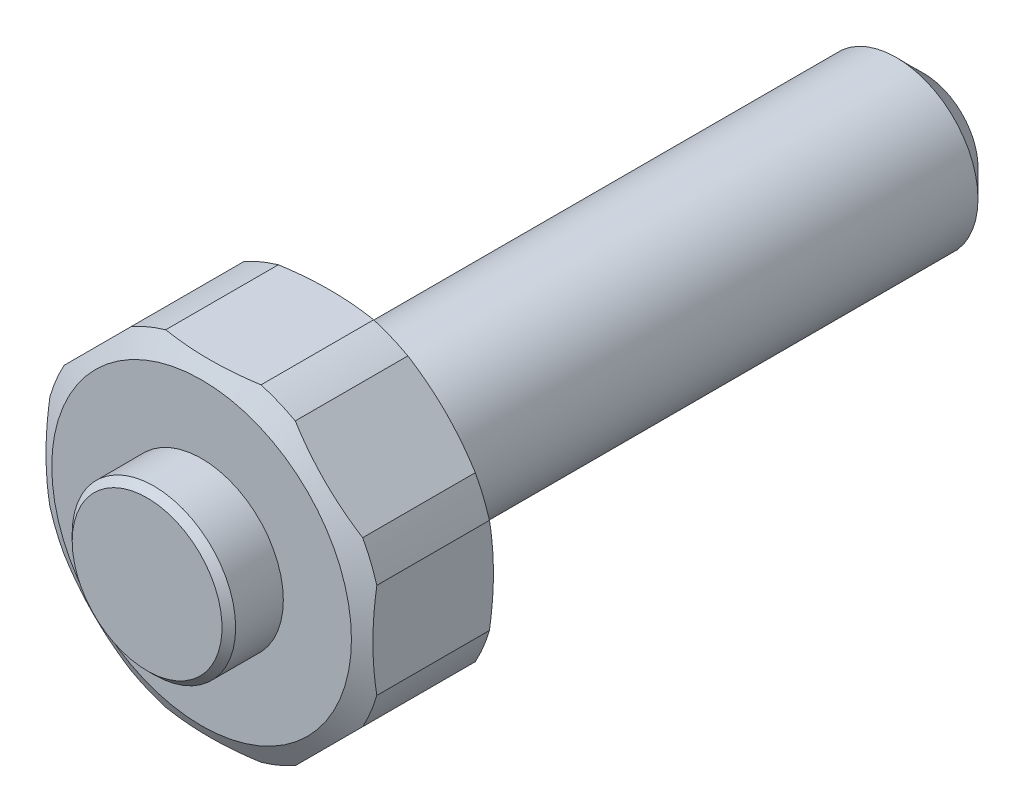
ISO-10303-21;
HEADER;
FILE_DESCRIPTION(('STEP AP214'),'2;1');
FILE_NAME('part.step','',(''),(''),'','','');
FILE_SCHEMA(('AUTOMOTIVE_DESIGN { 1 0 10303 214 1 1 1 1 }'));
ENDSEC;
DATA;
#1=APPLICATION_CONTEXT('core data for automotive mechanical design processes');
#2=APPLICATION_PROTOCOL_DEFINITION('international standard','automotive_design',2000,#1);
#3=PRODUCT_CONTEXT('',#1,'mechanical');
#4=PRODUCT('Part','Part','',(#3));
#5=PRODUCT_RELATED_PRODUCT_CATEGORY('part','',(#4));
#6=PRODUCT_DEFINITION_FORMATION('','',#4);
#7=PRODUCT_DEFINITION_CONTEXT('part definition',#1,'design');
#8=PRODUCT_DEFINITION('design','',#6,#7);
#9=PRODUCT_DEFINITION_SHAPE('','',#8);
#10=(LENGTH_UNIT() NAMED_UNIT(*) SI_UNIT(.MILLI.,.METRE.));
#11=(NAMED_UNIT(*) PLANE_ANGLE_UNIT() SI_UNIT($,.RADIAN.));
#12=(NAMED_UNIT(*) SI_UNIT($,.STERADIAN.) SOLID_ANGLE_UNIT());
#13=UNCERTAINTY_MEASURE_WITH_UNIT(LENGTH_MEASURE(1.E-05),#10,'distance_accuracy_value','');
#14=(GEOMETRIC_REPRESENTATION_CONTEXT(3) GLOBAL_UNCERTAINTY_ASSIGNED_CONTEXT((#13)) GLOBAL_UNIT_ASSIGNED_CONTEXT((#10,
#11,#12)) REPRESENTATION_CONTEXT('',''));
#15=CARTESIAN_POINT('',(0.,0.,0.));
#16=DIRECTION('',(0.,0.,1.));
#17=DIRECTION('',(1.,0.,0.));
#18=AXIS2_PLACEMENT_3D('',#15,#16,#17);
#19=CARTESIAN_POINT('',(0.,0.,22.));
#20=DIRECTION('',(0.,0.,1.));
#21=DIRECTION('',(1.,0.,0.));
#22=AXIS2_PLACEMENT_3D('',#19,#20,#21);
#23=CYLINDRICAL_SURFACE('',#22,6.);
#24=CARTESIAN_POINT('',(0.,0.,-41.));
#25=DIRECTION('',(0.,0.,-1.));
#26=DIRECTION('',(-1.,0.,0.));
#27=AXIS2_PLACEMENT_3D('',#24,#25,#26);
#28=CIRCLE('',#27,6.);
#29=CARTESIAN_POINT('',(-6.,0.,-41.));
#30=VERTEX_POINT('',#29);
#31=EDGE_CURVE('E9',#30,#30,#28,.F.);
#32=ORIENTED_EDGE('',*,*,#31,.T.);
#33=EDGE_LOOP('',(#32));
#34=FACE_BOUND('',#33,.T.);
#35=CARTESIAN_POINT('',(0.,0.,0.));
#36=DIRECTION('',(0.,0.,1.));
#37=DIRECTION('',(1.,0.,0.));
#38=AXIS2_PLACEMENT_3D('',#35,#36,#37);
#39=CIRCLE('',#38,6.);
#40=CARTESIAN_POINT('',(6.,0.,0.));
#41=VERTEX_POINT('',#40);
#42=EDGE_CURVE('E193',#41,#41,#39,.T.);
#43=ORIENTED_EDGE('',*,*,#42,.F.);
#44=EDGE_LOOP('',(#43));
#45=FACE_BOUND('',#44,.T.);
#46=ADVANCED_FACE('F14',(#34,#45),#23,.T.);
#47=CARTESIAN_POINT('',(6.,0.,0.));
#48=DIRECTION('',(0.,0.,1.));
#49=DIRECTION('',(1.,0.,0.));
#50=AXIS2_PLACEMENT_3D('',#47,#48,#49);
#51=PLANE('',#50);
#52=ORIENTED_EDGE('',*,*,#42,.T.);
#53=EDGE_LOOP('',(#52));
#54=FACE_BOUND('',#53,.T.);
#55=CARTESIAN_POINT('',(0.,0.,0.));
#56=DIRECTION('',(0.,0.,-1.));
#57=DIRECTION('',(-1.,0.,0.));
#58=AXIS2_PLACEMENT_3D('',#55,#56,#57);
#59=CIRCLE('',#58,11.);
#60=CARTESIAN_POINT('',(-11.,0.,0.));
#61=VERTEX_POINT('',#60);
#62=EDGE_CURVE('E550',#61,#61,#59,.T.);
#63=ORIENTED_EDGE('',*,*,#62,.T.);
#64=EDGE_LOOP('',(#63));
#65=FACE_BOUND('',#64,.T.);
#66=ADVANCED_FACE('F311',(#54,#65),#51,.F.);
#67=CARTESIAN_POINT('',(0.,0.,-58.));
#68=DIRECTION('',(0.,0.,-1.));
#69=DIRECTION('',(-1.,0.,0.));
#70=AXIS2_PLACEMENT_3D('',#67,#68,#69);
#71=CYLINDRICAL_SURFACE('',#70,12.5);
#72=CARTESIAN_POINT('',(0.,0.,9.1339745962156));
#73=DIRECTION('',(0.,0.,-1.));
#74=DIRECTION('',(-1.,0.,0.));
#75=AXIS2_PLACEMENT_3D('',#72,#73,#74);
#76=CIRCLE('',#75,12.5);
#77=CARTESIAN_POINT('',(3.5,-12.,9.1339745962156));
#78=VERTEX_POINT('',#77);
#79=CARTESIAN_POINT('',(6.01040764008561,-10.9601551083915,9.1339745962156));
#80=VERTEX_POINT('',#79);
#81=EDGE_CURVE('E608',#78,#80,#76,.F.);
#82=ORIENTED_EDGE('',*,*,#81,.F.);
#83=DIRECTION('',(0.,0.,-1.));
#84=VECTOR('',#83,1.);
#85=CARTESIAN_POINT('',(3.5,-12.,-58.));
#86=LINE('',#85,#84);
#87=CARTESIAN_POINT('',(3.5,-12.,0.866025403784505));
#88=VERTEX_POINT('',#87);
#89=EDGE_CURVE('E355',#78,#88,#86,.T.);
#90=ORIENTED_EDGE('',*,*,#89,.T.);
#91=CARTESIAN_POINT('',(0.,0.,0.866025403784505));
#92=DIRECTION('',(0.,0.,1.));
#93=DIRECTION('',(1.,0.,0.));
#94=AXIS2_PLACEMENT_3D('',#91,#92,#93);
#95=CIRCLE('',#94,12.5);
#96=CARTESIAN_POINT('',(6.01040764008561,-10.9601551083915,0.866025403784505));
#97=VERTEX_POINT('',#96);
#98=EDGE_CURVE('E593',#97,#88,#95,.F.);
#99=ORIENTED_EDGE('',*,*,#98,.F.);
#100=DIRECTION('',(0.,0.,-1.));
#101=VECTOR('',#100,1.);
#102=CARTESIAN_POINT('',(6.01040764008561,-10.9601551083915,-58.));
#103=LINE('',#102,#101);
#104=EDGE_CURVE('E187',#80,#97,#103,.T.);
#105=ORIENTED_EDGE('',*,*,#104,.F.);
#106=EDGE_LOOP('',(#82,#90,#99,#105));
#107=FACE_BOUND('',#106,.T.);
#108=ADVANCED_FACE('F307',(#107),#71,.T.);
#109=CARTESIAN_POINT('',(12.,-3.5,0.866025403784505));
#110=VERTEX_POINT('',#109);
#111=CARTESIAN_POINT('',(10.9601551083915,-6.01040764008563,0.866025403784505));
#112=VERTEX_POINT('',#111);
#113=EDGE_CURVE('E29',#110,#112,#95,.F.);
#114=ORIENTED_EDGE('',*,*,#113,.F.);
#115=DIRECTION('',(0.,0.,-1.));
#116=VECTOR('',#115,1.);
#117=CARTESIAN_POINT('',(12.,-3.5,-58.));
#118=LINE('',#117,#116);
#119=CARTESIAN_POINT('',(12.,-3.5,9.1339745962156));
#120=VERTEX_POINT('',#119);
#121=EDGE_CURVE('E181',#120,#110,#118,.T.);
#122=ORIENTED_EDGE('',*,*,#121,.F.);
#123=CARTESIAN_POINT('',(10.9601551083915,-6.01040764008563,9.1339745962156));
#124=VERTEX_POINT('',#123);
#125=EDGE_CURVE('E606',#124,#120,#76,.F.);
#126=ORIENTED_EDGE('',*,*,#125,.F.);
#127=DIRECTION('',(0.,0.,-1.));
#128=VECTOR('',#127,1.);
#129=CARTESIAN_POINT('',(10.9601551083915,-6.01040764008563,-58.));
#130=LINE('',#129,#128);
#131=EDGE_CURVE('E184',#112,#124,#130,.F.);
#132=ORIENTED_EDGE('',*,*,#131,.F.);
#133=EDGE_LOOP('',(#114,#122,#126,#132));
#134=FACE_BOUND('',#133,.T.);
#135=ADVANCED_FACE('F310',(#134),#71,.T.);
#136=CARTESIAN_POINT('',(10.9601551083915,6.01040764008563,0.866025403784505));
#137=VERTEX_POINT('',#136);
#138=CARTESIAN_POINT('',(12.,3.5,0.866025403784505));
#139=VERTEX_POINT('',#138);
#140=EDGE_CURVE('E35',#137,#139,#95,.F.);
#141=ORIENTED_EDGE('',*,*,#140,.F.);
#142=DIRECTION('',(0.,0.,-1.));
#143=VECTOR('',#142,1.);
#144=CARTESIAN_POINT('',(10.9601551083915,6.01040764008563,-58.));
#145=LINE('',#144,#143);
#146=CARTESIAN_POINT('',(10.9601551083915,6.01040764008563,9.1339745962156));
#147=VERTEX_POINT('',#146);
#148=EDGE_CURVE('E175',#147,#137,#145,.T.);
#149=ORIENTED_EDGE('',*,*,#148,.F.);
#150=CARTESIAN_POINT('',(12.,3.5,9.1339745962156));
#151=VERTEX_POINT('',#150);
#152=EDGE_CURVE('E605',#151,#147,#76,.F.);
#153=ORIENTED_EDGE('',*,*,#152,.F.);
#154=DIRECTION('',(0.,0.,-1.));
#155=VECTOR('',#154,1.);
#156=CARTESIAN_POINT('',(12.,3.5,-58.));
#157=LINE('',#156,#155);
#158=EDGE_CURVE('E178',#139,#151,#157,.F.);
#159=ORIENTED_EDGE('',*,*,#158,.F.);
#160=EDGE_LOOP('',(#141,#149,#153,#159));
#161=FACE_BOUND('',#160,.T.);
#162=ADVANCED_FACE('F319',(#161),#71,.T.);
#163=CARTESIAN_POINT('',(3.5,12.,0.866025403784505));
#164=VERTEX_POINT('',#163);
#165=CARTESIAN_POINT('',(6.01040764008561,10.9601551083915,0.866025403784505));
#166=VERTEX_POINT('',#165);
#167=EDGE_CURVE('E549',#164,#166,#95,.F.);
#168=ORIENTED_EDGE('',*,*,#167,.F.);
#169=DIRECTION('',(0.,0.,-1.));
#170=VECTOR('',#169,1.);
#171=CARTESIAN_POINT('',(3.5,12.,-58.));
#172=LINE('',#171,#170);
#173=CARTESIAN_POINT('',(3.5,12.,9.1339745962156));
#174=VERTEX_POINT('',#173);
#175=EDGE_CURVE('E169',#174,#164,#172,.T.);
#176=ORIENTED_EDGE('',*,*,#175,.F.);
#177=CARTESIAN_POINT('',(6.01040764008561,10.9601551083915,9.1339745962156));
#178=VERTEX_POINT('',#177);
#179=EDGE_CURVE('E603',#178,#174,#76,.F.);
#180=ORIENTED_EDGE('',*,*,#179,.F.);
#181=DIRECTION('',(0.,0.,-1.));
#182=VECTOR('',#181,1.);
#183=CARTESIAN_POINT('',(6.01040764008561,10.9601551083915,-58.));
#184=LINE('',#183,#182);
#185=EDGE_CURVE('E172',#166,#178,#184,.F.);
#186=ORIENTED_EDGE('',*,*,#185,.F.);
#187=EDGE_LOOP('',(#168,#176,#180,#186));
#188=FACE_BOUND('',#187,.T.);
#189=ADVANCED_FACE('F493',(#188),#71,.T.);
#190=CARTESIAN_POINT('',(-6.0104076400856,10.9601551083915,0.866025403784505));
#191=VERTEX_POINT('',#190);
#192=CARTESIAN_POINT('',(-3.5,12.,0.866025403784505));
#193=VERTEX_POINT('',#192);
#194=EDGE_CURVE('E628',#191,#193,#95,.F.);
#195=ORIENTED_EDGE('',*,*,#194,.F.);
#196=DIRECTION('',(0.,0.,-1.));
#197=VECTOR('',#196,1.);
#198=CARTESIAN_POINT('',(-6.01040764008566,10.9601551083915,-58.));
#199=LINE('',#198,#197);
#200=CARTESIAN_POINT('',(-6.0104076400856,10.9601551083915,9.1339745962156));
#201=VERTEX_POINT('',#200);
#202=EDGE_CURVE('E158',#201,#191,#199,.T.);
#203=ORIENTED_EDGE('',*,*,#202,.F.);
#204=CARTESIAN_POINT('',(-3.5,12.,9.1339745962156));
#205=VERTEX_POINT('',#204);
#206=EDGE_CURVE('E602',#205,#201,#76,.F.);
#207=ORIENTED_EDGE('',*,*,#206,.F.);
#208=DIRECTION('',(0.,0.,-1.));
#209=VECTOR('',#208,1.);
#210=CARTESIAN_POINT('',(-3.5,12.,-58.));
#211=LINE('',#210,#209);
#212=EDGE_CURVE('E166',#193,#205,#211,.F.);
#213=ORIENTED_EDGE('',*,*,#212,.F.);
#214=EDGE_LOOP('',(#195,#203,#207,#213));
#215=FACE_BOUND('',#214,.T.);
#216=ADVANCED_FACE('F486',(#215),#71,.T.);
#217=DIRECTION('',(0.,0.,-1.));
#218=VECTOR('',#217,1.);
#219=CARTESIAN_POINT('',(-12.,-3.5,-58.));
#220=LINE('',#219,#218);
#221=CARTESIAN_POINT('',(-12.,-3.5,9.1339745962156));
#222=VERTEX_POINT('',#221);
#223=CARTESIAN_POINT('',(-12.,-3.5,0.866025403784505));
#224=VERTEX_POINT('',#223);
#225=EDGE_CURVE('E145',#222,#224,#220,.T.);
#226=ORIENTED_EDGE('',*,*,#225,.T.);
#227=CARTESIAN_POINT('',(-10.9601551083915,-6.01040764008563,0.866025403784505));
#228=VERTEX_POINT('',#227);
#229=EDGE_CURVE('E633',#228,#224,#95,.F.);
#230=ORIENTED_EDGE('',*,*,#229,.F.);
#231=DIRECTION('',(0.,0.,-1.));
#232=VECTOR('',#231,1.);
#233=CARTESIAN_POINT('',(-10.9601551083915,-6.01040764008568,-58.));
#234=LINE('',#233,#232);
#235=CARTESIAN_POINT('',(-10.9601551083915,-6.01040764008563,9.1339745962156));
#236=VERTEX_POINT('',#235);
#237=EDGE_CURVE('E148',#228,#236,#234,.F.);
#238=ORIENTED_EDGE('',*,*,#237,.T.);
#239=EDGE_CURVE('E131',#222,#236,#76,.F.);
#240=ORIENTED_EDGE('',*,*,#239,.F.);
#241=EDGE_LOOP('',(#226,#230,#238,#240));
#242=FACE_BOUND('',#241,.T.);
#243=ADVANCED_FACE('F143',(#242),#71,.T.);
#244=CARTESIAN_POINT('',(-12.,3.5,0.866025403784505));
#245=VERTEX_POINT('',#244);
#246=CARTESIAN_POINT('',(-10.9601551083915,6.0104076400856,0.866025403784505));
#247=VERTEX_POINT('',#246);
#248=EDGE_CURVE('E632',#245,#247,#95,.F.);
#249=ORIENTED_EDGE('',*,*,#248,.F.);
#250=DIRECTION('',(0.,0.,-1.));
#251=VECTOR('',#250,1.);
#252=CARTESIAN_POINT('',(-12.,3.5,-58.));
#253=LINE('',#252,#251);
#254=CARTESIAN_POINT('',(-12.,3.5,9.1339745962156));
#255=VERTEX_POINT('',#254);
#256=EDGE_CURVE('E155',#245,#255,#253,.F.);
#257=ORIENTED_EDGE('',*,*,#256,.T.);
#258=CARTESIAN_POINT('',(-10.9601551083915,6.0104076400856,9.1339745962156));
#259=VERTEX_POINT('',#258);
#260=EDGE_CURVE('E134',#259,#255,#76,.F.);
#261=ORIENTED_EDGE('',*,*,#260,.F.);
#262=DIRECTION('',(0.,0.,-1.));
#263=VECTOR('',#262,1.);
#264=CARTESIAN_POINT('',(-10.9601551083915,6.01040764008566,-58.));
#265=LINE('',#264,#263);
#266=EDGE_CURVE('E154',#247,#259,#265,.F.);
#267=ORIENTED_EDGE('',*,*,#266,.F.);
#268=EDGE_LOOP('',(#249,#257,#261,#267));
#269=FACE_BOUND('',#268,.T.);
#270=ADVANCED_FACE('F325',(#269),#71,.T.);
#271=DIRECTION('',(0.,0.,-1.));
#272=VECTOR('',#271,1.);
#273=CARTESIAN_POINT('',(-6.01040764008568,-10.9601551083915,-58.));
#274=LINE('',#273,#272);
#275=CARTESIAN_POINT('',(-6.01040764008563,-10.9601551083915,9.1339745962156));
#276=VERTEX_POINT('',#275);
#277=CARTESIAN_POINT('',(-6.01040764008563,-10.9601551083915,0.866025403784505));
#278=VERTEX_POINT('',#277);
#279=EDGE_CURVE('E160',#276,#278,#274,.T.);
#280=ORIENTED_EDGE('',*,*,#279,.T.);
#281=CARTESIAN_POINT('',(-3.5,-12.,0.866025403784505));
#282=VERTEX_POINT('',#281);
#283=EDGE_CURVE('E623',#282,#278,#95,.F.);
#284=ORIENTED_EDGE('',*,*,#283,.F.);
#285=DIRECTION('',(0.,0.,-1.));
#286=VECTOR('',#285,1.);
#287=CARTESIAN_POINT('',(-3.5,-12.,-58.));
#288=LINE('',#287,#286);
#289=CARTESIAN_POINT('',(-3.5,-12.,9.1339745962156));
#290=VERTEX_POINT('',#289);
#291=EDGE_CURVE('E205',#282,#290,#288,.F.);
#292=ORIENTED_EDGE('',*,*,#291,.T.);
#293=EDGE_CURVE('E150',#276,#290,#76,.F.);
#294=ORIENTED_EDGE('',*,*,#293,.F.);
#295=EDGE_LOOP('',(#280,#284,#292,#294));
#296=FACE_BOUND('',#295,.T.);
#297=ADVANCED_FACE('F216',(#296),#71,.T.);
#298=CARTESIAN_POINT('',(0.,0.,2.5495315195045));
#299=DIRECTION('',(0.,0.,1.));
#300=DIRECTION('',(1.,0.,0.));
#301=AXIS2_PLACEMENT_3D('',#298,#299,#300);
#302=CONICAL_SURFACE('',#301,15.4159181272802,1.0471975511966);
#303=CARTESIAN_POINT('',(10.9610297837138,-6.00953296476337,0.866225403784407));
#304=CARTESIAN_POINT('',(10.7557968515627,-6.21476589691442,0.819258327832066));
#305=CARTESIAN_POINT('',(10.5499383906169,-6.42062435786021,0.777587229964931));
#306=CARTESIAN_POINT('',(10.137202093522,-6.83336065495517,0.70550975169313));
#307=CARTESIAN_POINT('',(9.93032407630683,-7.04023867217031,0.67510545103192));
#308=CARTESIAN_POINT('',(9.51725429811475,-7.45330845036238,0.62641694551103));
#309=CARTESIAN_POINT('',(9.31106732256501,-7.65949542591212,0.608052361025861));
#310=CARTESIAN_POINT('',(8.89834733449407,-8.07221541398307,0.583519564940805));
#311=CARTESIAN_POINT('',(8.69181435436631,-8.27874839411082,0.577350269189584));
#312=CARTESIAN_POINT('',(8.2787483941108,-8.69181435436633,0.577350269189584));
#313=CARTESIAN_POINT('',(8.07221541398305,-8.89834733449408,0.583519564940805));
#314=CARTESIAN_POINT('',(7.65949542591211,-9.31106732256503,0.608052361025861));
#315=CARTESIAN_POINT('',(7.45330845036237,-9.51725429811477,0.62641694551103));
#316=CARTESIAN_POINT('',(7.04023867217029,-9.93032407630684,0.67510545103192));
#317=CARTESIAN_POINT('',(6.83336065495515,-10.137202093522,0.70550975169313));
#318=CARTESIAN_POINT('',(6.42062435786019,-10.5499383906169,0.77758722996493));
#319=CARTESIAN_POINT('',(6.21476589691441,-10.7557968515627,0.819258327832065));
#320=CARTESIAN_POINT('',(6.00953296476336,-10.9610297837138,0.866225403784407));
#321=B_SPLINE_CURVE_WITH_KNOTS('',3,(#303,#304,#305,#306,#307,#308,#309,#310,#311,#312,#313,
#314,#315,#316,#317,#318,#319,#320),.UNSPECIFIED.,.F.,.F.,(4,2,2,2,2,2,2,2,4),(0.,
0.882048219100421,1.76425917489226,2.64051865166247,3.51670022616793,4.39288180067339,
5.2691412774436,6.15135223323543,7.03340045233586),.UNSPECIFIED.);
#322=EDGE_CURVE('E269',#112,#97,#321,.T.);
#323=ORIENTED_EDGE('',*,*,#322,.T.);
#324=ORIENTED_EDGE('',*,*,#98,.T.);
#325=CARTESIAN_POINT('',(-14.9188294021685,-12.,4.7031277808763));
#326=CARTESIAN_POINT('',(-14.6919138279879,-12.,4.60104600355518));
#327=CARTESIAN_POINT('',(-14.464658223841,-12.,4.49972066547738));
#328=CARTESIAN_POINT('',(-14.0094029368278,-12.,4.29874518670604));
#329=CARTESIAN_POINT('',(-13.7814032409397,-12.,4.19909507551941));
#330=CARTESIAN_POINT('',(-13.0961002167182,-12.,3.90286156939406));
#331=CARTESIAN_POINT('',(-12.6375959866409,-12.,3.70904152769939));
#332=CARTESIAN_POINT('',(-11.714140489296,-12.,3.32928856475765));
#333=CARTESIAN_POINT('',(-11.2491671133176,-12.,3.14340924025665));
#334=CARTESIAN_POINT('',(-10.3148928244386,-12.,2.78289851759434));
#335=CARTESIAN_POINT('',(-9.84559219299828,-12.,2.60826639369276));
#336=CARTESIAN_POINT('',(-8.90705094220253,-12.,2.27469533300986));
#337=CARTESIAN_POINT('',(-8.43786305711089,-12.,2.115608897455));
#338=CARTESIAN_POINT('',(-7.49403784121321,-12.,1.81423618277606));
#339=CARTESIAN_POINT('',(-7.01940010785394,-12.,1.67195115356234));
#340=CARTESIAN_POINT('',(-6.06542424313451,-12.,1.40832238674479));
#341=CARTESIAN_POINT('',(-5.58609883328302,-12.,1.2869330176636));
#342=CARTESIAN_POINT('',(-4.6218358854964,-12.,1.06904936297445));
#343=CARTESIAN_POINT('',(-4.1368997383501,-12.,0.97254904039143));
#344=CARTESIAN_POINT('',(-3.36893010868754,-12.,0.843532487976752));
#345=CARTESIAN_POINT('',(-3.08752263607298,-12.,0.80123995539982));
#346=CARTESIAN_POINT('',(-2.52334358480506,-12.,0.727090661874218));
#347=CARTESIAN_POINT('',(-2.24057211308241,-12.,0.695233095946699));
#348=CARTESIAN_POINT('',(-1.6739517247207,-12.,0.642570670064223));
#349=CARTESIAN_POINT('',(-1.39010264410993,-12.,0.621767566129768));
#350=CARTESIAN_POINT('',(-0.821788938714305,-12.,0.591655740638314));
#351=CARTESIAN_POINT('',(-0.537324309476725,-12.,0.582347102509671));
#352=CARTESIAN_POINT('',(0.0320250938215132,-12.,0.575424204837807));
#353=CARTESIAN_POINT('',(0.316910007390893,-12.,0.577821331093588));
#354=CARTESIAN_POINT('',(0.88633713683,-12.,0.594282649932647));
#355=CARTESIAN_POINT('',(1.17087935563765,-12.,0.608346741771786));
#356=CARTESIAN_POINT('',(1.73908078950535,-12.,0.647834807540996));
#357=CARTESIAN_POINT('',(2.02274025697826,-12.,0.673255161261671));
#358=CARTESIAN_POINT('',(2.58888865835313,-12.,0.734930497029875));
#359=CARTESIAN_POINT('',(2.87137747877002,-12.,0.771186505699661));
#360=CARTESIAN_POINT('',(3.7468065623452,-12.,0.899648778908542));
#361=CARTESIAN_POINT('',(4.33722942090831,-12.,1.00936119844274));
#362=CARTESIAN_POINT('',(5.5098985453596,-12.,1.26631503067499));
#363=CARTESIAN_POINT('',(6.09214074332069,-12.,1.4135744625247));
#364=CARTESIAN_POINT('',(7.25041645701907,-12.,1.73846605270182));
#365=CARTESIAN_POINT('',(7.82641718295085,-12.,1.91621366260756));
#366=CARTESIAN_POINT('',(8.97053682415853,-12.,2.29497159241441));
#367=CARTESIAN_POINT('',(9.53865683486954,-12.,2.49597864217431));
#368=CARTESIAN_POINT('',(10.6748965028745,-12.,2.91849340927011));
#369=CARTESIAN_POINT('',(11.2429352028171,-12.,3.14021720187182));
#370=CARTESIAN_POINT('',(12.3732525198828,-12.,3.59793560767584));
#371=CARTESIAN_POINT('',(12.9355306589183,-12.,3.83393139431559));
#372=CARTESIAN_POINT('',(14.0498267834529,-12.,4.3146984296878));
#373=CARTESIAN_POINT('',(14.6018913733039,-12.,4.55936206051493));
#374=CARTESIAN_POINT('',(15.4269629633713,-12.,4.93279527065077));
#375=CARTESIAN_POINT('',(15.7014431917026,-12.,5.05832737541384));
#376=CARTESIAN_POINT('',(16.2495039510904,-12.,5.31132718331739));
#377=CARTESIAN_POINT('',(16.5230844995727,-12.,5.43879484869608));
#378=CARTESIAN_POINT('',(16.7962614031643,-12.,5.5671222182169));
#379=B_SPLINE_CURVE_WITH_KNOTS('',3,(#325,#326,#327,#328,#329,#330,#331,#332,#333,#334,#335,
#336,#337,#338,#339,#340,#341,#342,#343,#344,#345,#346,#347,#348,#349,#350,#351,#352,#353,#354,
#355,#356,#357,#358,#359,#360,#361,#362,#363,#364,#365,#366,#367,#368,#369,#370,#371,#372,#373,
#374,#375,#376,#377,#378),.UNSPECIFIED.,.F.,.F.,(4,2,2,2,2,2,2,2,2,2,2,2,2,2,2,2,2,2,2,2,2,2,2,
2,2,2,4),(0.,0.746457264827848,1.49292766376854,2.98620758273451,4.48834418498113,
5.99038376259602,7.47640484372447,8.96253640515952,10.4453802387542,11.9278640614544,
12.7814006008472,13.6348712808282,14.4884774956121,15.3420899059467,16.1965327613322,
17.0509682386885,17.905131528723,18.7593757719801,20.5592996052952,22.3600888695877,
24.1678542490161,25.9753657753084,27.8044536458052,29.633692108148,31.4451470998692,
32.3506131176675,33.2560614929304),.UNSPECIFIED.);
#380=EDGE_CURVE('E196',#282,#88,#379,.T.);
#381=ORIENTED_EDGE('',*,*,#380,.F.);
#382=ORIENTED_EDGE('',*,*,#283,.T.);
#383=CARTESIAN_POINT('',(-10.9610297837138,-6.00953296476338,0.866225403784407));
#384=CARTESIAN_POINT('',(-10.7557968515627,-6.21476589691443,0.819258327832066));
#385=CARTESIAN_POINT('',(-10.5499383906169,-6.42062435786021,0.777587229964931));
#386=CARTESIAN_POINT('',(-10.137202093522,-6.83336065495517,0.70550975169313));
#387=CARTESIAN_POINT('',(-9.93032407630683,-7.04023867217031,0.675105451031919));
#388=CARTESIAN_POINT('',(-9.51725429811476,-7.45330845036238,0.626416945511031));
#389=CARTESIAN_POINT('',(-9.31106732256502,-7.65949542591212,0.608052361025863));
#390=CARTESIAN_POINT('',(-8.89834733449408,-8.07221541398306,0.583519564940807));
#391=CARTESIAN_POINT('',(-8.69181435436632,-8.27874839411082,0.577350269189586));
#392=CARTESIAN_POINT('',(-8.27874839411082,-8.69181435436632,0.577350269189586));
#393=CARTESIAN_POINT('',(-8.07221541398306,-8.89834733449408,0.583519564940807));
#394=CARTESIAN_POINT('',(-7.65949542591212,-9.31106732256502,0.608052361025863));
#395=CARTESIAN_POINT('',(-7.45330845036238,-9.51725429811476,0.626416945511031));
#396=CARTESIAN_POINT('',(-7.04023867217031,-9.93032407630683,0.67510545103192));
#397=CARTESIAN_POINT('',(-6.83336065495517,-10.137202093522,0.70550975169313));
#398=CARTESIAN_POINT('',(-6.42062435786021,-10.5499383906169,0.777587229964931));
#399=CARTESIAN_POINT('',(-6.21476589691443,-10.7557968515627,0.819258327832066));
#400=CARTESIAN_POINT('',(-6.00953296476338,-10.9610297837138,0.866225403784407));
#401=B_SPLINE_CURVE_WITH_KNOTS('',3,(#383,#384,#385,#386,#387,#388,#389,#390,#391,#392,#393,
#394,#395,#396,#397,#398,#399,#400),.UNSPECIFIED.,.F.,.F.,(4,2,2,2,2,2,2,2,4),(0.,
0.882048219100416,1.76425917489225,2.64051865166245,3.51670022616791,4.39288180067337,
5.26914127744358,6.1513522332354,7.03340045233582),.UNSPECIFIED.);
#402=EDGE_CURVE('E226',#228,#278,#401,.T.);
#403=ORIENTED_EDGE('',*,*,#402,.F.);
#404=ORIENTED_EDGE('',*,*,#229,.T.);
#405=CARTESIAN_POINT('',(-12.,-14.9188294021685,4.7031277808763));
#406=CARTESIAN_POINT('',(-12.,-14.6919138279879,4.60104600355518));
#407=CARTESIAN_POINT('',(-12.,-14.464658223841,4.49972066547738));
#408=CARTESIAN_POINT('',(-12.,-14.0094029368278,4.29874518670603));
#409=CARTESIAN_POINT('',(-12.,-13.7814032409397,4.19909507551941));
#410=CARTESIAN_POINT('',(-12.,-13.0961002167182,3.90286156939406));
#411=CARTESIAN_POINT('',(-12.,-12.6375959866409,3.70904152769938));
#412=CARTESIAN_POINT('',(-12.,-11.714140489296,3.32928856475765));
#413=CARTESIAN_POINT('',(-12.,-11.2491671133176,3.14340924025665));
#414=CARTESIAN_POINT('',(-12.,-10.3148928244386,2.78289851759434));
#415=CARTESIAN_POINT('',(-12.,-9.84559219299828,2.60826639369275));
#416=CARTESIAN_POINT('',(-12.,-8.90705094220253,2.27469533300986));
#417=CARTESIAN_POINT('',(-12.,-8.43786305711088,2.11560889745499));
#418=CARTESIAN_POINT('',(-12.,-7.49403784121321,1.81423618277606));
#419=CARTESIAN_POINT('',(-12.,-7.01940010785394,1.67195115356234));
#420=CARTESIAN_POINT('',(-12.,-6.06542424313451,1.40832238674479));
#421=CARTESIAN_POINT('',(-12.,-5.58609883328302,1.2869330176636));
#422=CARTESIAN_POINT('',(-12.,-4.6218358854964,1.06904936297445));
#423=CARTESIAN_POINT('',(-12.,-4.1368997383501,0.97254904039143));
#424=CARTESIAN_POINT('',(-12.,-3.36893010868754,0.843532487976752));
#425=CARTESIAN_POINT('',(-12.,-3.08752263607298,0.80123995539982));
#426=CARTESIAN_POINT('',(-12.,-2.52334358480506,0.727090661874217));
#427=CARTESIAN_POINT('',(-12.,-2.24057211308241,0.695233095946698));
#428=CARTESIAN_POINT('',(-12.,-1.6739517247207,0.642570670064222));
#429=CARTESIAN_POINT('',(-12.,-1.39010264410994,0.621767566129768));
#430=CARTESIAN_POINT('',(-12.,-0.821788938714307,0.591655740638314));
#431=CARTESIAN_POINT('',(-12.,-0.537324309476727,0.582347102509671));
#432=CARTESIAN_POINT('',(-12.,0.0320250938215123,0.575424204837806));
#433=CARTESIAN_POINT('',(-12.,0.316910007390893,0.577821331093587));
#434=CARTESIAN_POINT('',(-12.,0.886337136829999,0.594282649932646));
#435=CARTESIAN_POINT('',(-12.,1.17087935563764,0.608346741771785));
#436=CARTESIAN_POINT('',(-12.,1.73908078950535,0.647834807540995));
#437=CARTESIAN_POINT('',(-12.,2.02274025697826,0.673255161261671));
#438=CARTESIAN_POINT('',(-12.,2.58888865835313,0.734930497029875));
#439=CARTESIAN_POINT('',(-12.,2.87137747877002,0.771186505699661));
#440=CARTESIAN_POINT('',(-12.,3.7468065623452,0.899648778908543));
#441=CARTESIAN_POINT('',(-12.,4.33722942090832,1.00936119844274));
#442=CARTESIAN_POINT('',(-12.,5.50989854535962,1.26631503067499));
#443=CARTESIAN_POINT('',(-12.,6.09214074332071,1.41357446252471));
#444=CARTESIAN_POINT('',(-12.,7.2504164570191,1.73846605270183));
#445=CARTESIAN_POINT('',(-12.,7.82641718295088,1.91621366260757));
#446=CARTESIAN_POINT('',(-12.,8.97053682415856,2.29497159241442));
#447=CARTESIAN_POINT('',(-12.,9.53865683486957,2.49597864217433));
#448=CARTESIAN_POINT('',(-12.,10.6748965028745,2.91849340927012));
#449=CARTESIAN_POINT('',(-12.,11.2429352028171,3.14021720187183));
#450=CARTESIAN_POINT('',(-12.,12.3732525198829,3.59793560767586));
#451=CARTESIAN_POINT('',(-12.,12.9355306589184,3.8339313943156));
#452=CARTESIAN_POINT('',(-12.,14.0498267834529,4.31469842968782));
#453=CARTESIAN_POINT('',(-12.,14.6018913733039,4.55936206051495));
#454=CARTESIAN_POINT('',(-12.,15.4269629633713,4.93279527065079));
#455=CARTESIAN_POINT('',(-12.,15.7014431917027,5.05832737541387));
#456=CARTESIAN_POINT('',(-12.,16.2495039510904,5.31132718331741));
#457=CARTESIAN_POINT('',(-12.,16.5230844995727,5.4387948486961));
#458=CARTESIAN_POINT('',(-12.,16.7962614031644,5.5671222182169));
#459=B_SPLINE_CURVE_WITH_KNOTS('',3,(#405,#406,#407,#408,#409,#410,#411,#412,#413,#414,#415,
#416,#417,#418,#419,#420,#421,#422,#423,#424,#425,#426,#427,#428,#429,#430,#431,#432,#433,#434,
#435,#436,#437,#438,#439,#440,#441,#442,#443,#444,#445,#446,#447,#448,#449,#450,#451,#452,#453,
#454,#455,#456,#457,#458),.UNSPECIFIED.,.F.,.F.,(4,2,2,2,2,2,2,2,2,2,2,2,2,2,2,2,2,2,2,2,2,2,2,
2,2,2,4),(0.,0.746457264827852,1.49292766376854,2.98620758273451,4.48834418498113,
5.99038376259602,7.47640484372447,8.96253640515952,10.4453802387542,11.9278640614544,
12.7814006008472,13.6348712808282,14.4884774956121,15.3420899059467,16.1965327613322,
17.0509682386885,17.905131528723,18.7593757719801,20.5592996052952,22.3600888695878,
24.1678542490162,25.9753657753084,27.8044536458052,29.6336921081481,31.4451470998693,
32.3506131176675,33.2560614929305),.UNSPECIFIED.);
#460=EDGE_CURVE('E153',#245,#224,#459,.F.);
#461=ORIENTED_EDGE('',*,*,#460,.F.);
#462=ORIENTED_EDGE('',*,*,#248,.T.);
#463=CARTESIAN_POINT('',(-10.9610297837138,6.00953296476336,0.866225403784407));
#464=CARTESIAN_POINT('',(-10.7557968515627,6.21476589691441,0.819258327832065));
#465=CARTESIAN_POINT('',(-10.5499383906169,6.42062435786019,0.77758722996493));
#466=CARTESIAN_POINT('',(-10.137202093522,6.83336065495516,0.705509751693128));
#467=CARTESIAN_POINT('',(-9.93032407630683,7.0402386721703,0.675105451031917));
#468=CARTESIAN_POINT('',(-9.51725429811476,7.45330845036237,0.626416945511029));
#469=CARTESIAN_POINT('',(-9.31106732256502,7.65949542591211,0.60805236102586));
#470=CARTESIAN_POINT('',(-8.89834733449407,8.07221541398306,0.583519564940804));
#471=CARTESIAN_POINT('',(-8.69181435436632,8.27874839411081,0.577350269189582));
#472=CARTESIAN_POINT('',(-8.27874839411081,8.69181435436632,0.577350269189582));
#473=CARTESIAN_POINT('',(-8.07221541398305,8.89834733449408,0.583519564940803));
#474=CARTESIAN_POINT('',(-7.65949542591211,9.31106732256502,0.60805236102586));
#475=CARTESIAN_POINT('',(-7.45330845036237,9.51725429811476,0.626416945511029));
#476=CARTESIAN_POINT('',(-7.04023867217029,9.93032407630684,0.675105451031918));
#477=CARTESIAN_POINT('',(-6.83336065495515,10.137202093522,0.705509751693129));
#478=CARTESIAN_POINT('',(-6.42062435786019,10.5499383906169,0.777587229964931));
#479=CARTESIAN_POINT('',(-6.2147658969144,10.7557968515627,0.819258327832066));
#480=CARTESIAN_POINT('',(-6.00953296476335,10.9610297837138,0.866225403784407));
#481=B_SPLINE_CURVE_WITH_KNOTS('',3,(#463,#464,#465,#466,#467,#468,#469,#470,#471,#472,#473,
#474,#475,#476,#477,#478,#479,#480),.UNSPECIFIED.,.F.,.F.,(4,2,2,2,2,2,2,2,4),(0.,
0.882048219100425,1.76425917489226,2.64051865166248,3.51670022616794,4.3928818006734,
5.26914127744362,6.15135223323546,7.03340045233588),.UNSPECIFIED.);
#482=EDGE_CURVE('E241',#247,#191,#481,.T.);
#483=ORIENTED_EDGE('',*,*,#482,.T.);
#484=ORIENTED_EDGE('',*,*,#194,.T.);
#485=CARTESIAN_POINT('',(-14.9188294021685,12.,4.70312778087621));
#486=CARTESIAN_POINT('',(-14.6919138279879,12.,4.60104600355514));
#487=CARTESIAN_POINT('',(-14.4646582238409,12.,4.49972066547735));
#488=CARTESIAN_POINT('',(-14.0094029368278,12.,4.29874518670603));
#489=CARTESIAN_POINT('',(-13.7814032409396,12.,4.1990950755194));
#490=CARTESIAN_POINT('',(-13.0961002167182,12.,3.90286156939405));
#491=CARTESIAN_POINT('',(-12.6375959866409,12.,3.70904152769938));
#492=CARTESIAN_POINT('',(-11.714140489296,12.,3.32928856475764));
#493=CARTESIAN_POINT('',(-11.2491671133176,12.,3.14340924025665));
#494=CARTESIAN_POINT('',(-10.3148928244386,12.,2.78289851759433));
#495=CARTESIAN_POINT('',(-9.84559219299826,12.,2.60826639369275));
#496=CARTESIAN_POINT('',(-8.90705094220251,12.,2.27469533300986));
#497=CARTESIAN_POINT('',(-8.43786305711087,12.,2.11560889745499));
#498=CARTESIAN_POINT('',(-7.4940378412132,12.,1.81423618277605));
#499=CARTESIAN_POINT('',(-7.01940010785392,12.,1.67195115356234));
#500=CARTESIAN_POINT('',(-6.0654242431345,12.,1.40832238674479));
#501=CARTESIAN_POINT('',(-5.58609883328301,12.,1.2869330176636));
#502=CARTESIAN_POINT('',(-4.62183588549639,12.,1.06904936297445));
#503=CARTESIAN_POINT('',(-4.13689973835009,12.,0.97254904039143));
#504=CARTESIAN_POINT('',(-3.36893010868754,12.,0.843532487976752));
#505=CARTESIAN_POINT('',(-3.08752263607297,12.,0.801239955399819));
#506=CARTESIAN_POINT('',(-2.52334358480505,12.,0.727090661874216));
#507=CARTESIAN_POINT('',(-2.2405721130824,12.,0.695233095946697));
#508=CARTESIAN_POINT('',(-1.67395172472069,12.,0.642570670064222));
#509=CARTESIAN_POINT('',(-1.39010264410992,12.,0.621767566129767));
#510=CARTESIAN_POINT('',(-0.821788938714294,12.,0.591655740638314));
#511=CARTESIAN_POINT('',(-0.537324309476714,12.,0.582347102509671));
#512=CARTESIAN_POINT('',(0.0320250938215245,12.,0.575424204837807));
#513=CARTESIAN_POINT('',(0.316910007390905,12.,0.577821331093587));
#514=CARTESIAN_POINT('',(0.88633713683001,12.,0.594282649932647));
#515=CARTESIAN_POINT('',(1.17087935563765,12.,0.608346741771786));
#516=CARTESIAN_POINT('',(1.73908078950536,12.,0.647834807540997));
#517=CARTESIAN_POINT('',(2.02274025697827,12.,0.673255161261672));
#518=CARTESIAN_POINT('',(2.58888865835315,12.,0.734930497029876));
#519=CARTESIAN_POINT('',(2.87137747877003,12.,0.771186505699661));
#520=CARTESIAN_POINT('',(3.74680656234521,12.,0.899648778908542));
#521=CARTESIAN_POINT('',(4.33722942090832,12.,1.00936119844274));
#522=CARTESIAN_POINT('',(5.50989854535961,12.,1.26631503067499));
#523=CARTESIAN_POINT('',(6.09214074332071,12.,1.41357446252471));
#524=CARTESIAN_POINT('',(7.25041645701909,12.,1.73846605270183));
#525=CARTESIAN_POINT('',(7.82641718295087,12.,1.91621366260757));
#526=CARTESIAN_POINT('',(8.97053682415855,12.,2.29497159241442));
#527=CARTESIAN_POINT('',(9.53865683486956,12.,2.49597864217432));
#528=CARTESIAN_POINT('',(10.6748965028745,12.,2.91849340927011));
#529=CARTESIAN_POINT('',(11.2429352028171,12.,3.14021720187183));
#530=CARTESIAN_POINT('',(12.3732525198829,12.,3.59793560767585));
#531=CARTESIAN_POINT('',(12.9355306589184,12.,3.8339313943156));
#532=CARTESIAN_POINT('',(14.0498267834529,12.,4.31469842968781));
#533=CARTESIAN_POINT('',(14.6018913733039,12.,4.55936206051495));
#534=CARTESIAN_POINT('',(15.4269629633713,12.,4.93279527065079));
#535=CARTESIAN_POINT('',(15.7014431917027,12.,5.05832737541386));
#536=CARTESIAN_POINT('',(16.2495039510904,12.,5.31132718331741));
#537=CARTESIAN_POINT('',(16.5230844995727,12.,5.4387948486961));
#538=CARTESIAN_POINT('',(16.7962614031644,12.,5.5671222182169));
#539=B_SPLINE_CURVE_WITH_KNOTS('',3,(#485,#486,#487,#488,#489,#490,#491,#492,#493,#494,#495,
#496,#497,#498,#499,#500,#501,#502,#503,#504,#505,#506,#507,#508,#509,#510,#511,#512,#513,#514,
#515,#516,#517,#518,#519,#520,#521,#522,#523,#524,#525,#526,#527,#528,#529,#530,#531,#532,#533,
#534,#535,#536,#537,#538),.UNSPECIFIED.,.F.,.F.,(4,2,2,2,2,2,2,2,2,2,2,2,2,2,2,2,2,2,2,2,2,2,2,
2,2,2,4),(0.,0.746457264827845,1.49292766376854,2.9862075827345,4.48834418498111,5.990383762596,
7.47640484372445,8.9625364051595,10.4453802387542,11.9278640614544,12.7814006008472,
13.6348712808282,14.4884774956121,15.3420899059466,16.1965327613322,17.0509682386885,
17.905131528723,18.75937577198,20.5592996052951,22.3600888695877,24.1678542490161,
25.9753657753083,27.8044536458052,29.633692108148,31.4451470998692,32.3506131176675,
33.2560614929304),.UNSPECIFIED.);
#540=EDGE_CURVE('E249',#193,#164,#539,.T.);
#541=ORIENTED_EDGE('',*,*,#540,.T.);
#542=ORIENTED_EDGE('',*,*,#167,.T.);
#543=CARTESIAN_POINT('',(6.00953296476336,10.9610297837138,0.866225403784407));
#544=CARTESIAN_POINT('',(6.21476589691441,10.7557968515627,0.819258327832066));
#545=CARTESIAN_POINT('',(6.42062435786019,10.5499383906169,0.777587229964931));
#546=CARTESIAN_POINT('',(6.83336065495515,10.137202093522,0.70550975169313));
#547=CARTESIAN_POINT('',(7.04023867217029,9.93032407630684,0.67510545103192));
#548=CARTESIAN_POINT('',(7.45330845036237,9.51725429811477,0.62641694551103));
#549=CARTESIAN_POINT('',(7.65949542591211,9.31106732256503,0.608052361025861));
#550=CARTESIAN_POINT('',(8.07221541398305,8.89834733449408,0.583519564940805));
#551=CARTESIAN_POINT('',(8.2787483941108,8.69181435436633,0.577350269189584));
#552=CARTESIAN_POINT('',(8.69181435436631,8.27874839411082,0.577350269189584));
#553=CARTESIAN_POINT('',(8.89834733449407,8.07221541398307,0.583519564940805));
#554=CARTESIAN_POINT('',(9.31106732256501,7.65949542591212,0.608052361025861));
#555=CARTESIAN_POINT('',(9.51725429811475,7.45330845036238,0.62641694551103));
#556=CARTESIAN_POINT('',(9.93032407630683,7.04023867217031,0.675105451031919));
#557=CARTESIAN_POINT('',(10.137202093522,6.83336065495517,0.70550975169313));
#558=CARTESIAN_POINT('',(10.5499383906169,6.42062435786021,0.777587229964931));
#559=CARTESIAN_POINT('',(10.7557968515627,6.21476589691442,0.819258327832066));
#560=CARTESIAN_POINT('',(10.9610297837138,6.00953296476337,0.866225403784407));
#561=B_SPLINE_CURVE_WITH_KNOTS('',3,(#543,#544,#545,#546,#547,#548,#549,#550,#551,#552,#553,
#554,#555,#556,#557,#558,#559,#560),.UNSPECIFIED.,.F.,.F.,(4,2,2,2,2,2,2,2,4),(0.,
0.882048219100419,1.76425917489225,2.64051865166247,3.51670022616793,4.39288180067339,
5.2691412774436,6.15135223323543,7.03340045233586),.UNSPECIFIED.);
#562=EDGE_CURVE('E256',#166,#137,#561,.T.);
#563=ORIENTED_EDGE('',*,*,#562,.T.);
#564=ORIENTED_EDGE('',*,*,#140,.T.);
#565=CARTESIAN_POINT('',(12.,-14.9188294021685,4.7031277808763));
#566=CARTESIAN_POINT('',(12.,-14.6919138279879,4.60104600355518));
#567=CARTESIAN_POINT('',(12.,-14.464658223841,4.49972066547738));
#568=CARTESIAN_POINT('',(12.,-14.0094029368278,4.29874518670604));
#569=CARTESIAN_POINT('',(12.,-13.7814032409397,4.19909507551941));
#570=CARTESIAN_POINT('',(12.,-13.0961002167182,3.90286156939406));
#571=CARTESIAN_POINT('',(12.,-12.6375959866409,3.70904152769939));
#572=CARTESIAN_POINT('',(12.,-11.714140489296,3.32928856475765));
#573=CARTESIAN_POINT('',(12.,-11.2491671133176,3.14340924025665));
#574=CARTESIAN_POINT('',(12.,-10.3148928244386,2.78289851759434));
#575=CARTESIAN_POINT('',(12.,-9.84559219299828,2.60826639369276));
#576=CARTESIAN_POINT('',(12.,-8.90705094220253,2.27469533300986));
#577=CARTESIAN_POINT('',(12.,-8.43786305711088,2.11560889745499));
#578=CARTESIAN_POINT('',(12.,-7.49403784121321,1.81423618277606));
#579=CARTESIAN_POINT('',(12.,-7.01940010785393,1.67195115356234));
#580=CARTESIAN_POINT('',(12.,-6.06542424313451,1.40832238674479));
#581=CARTESIAN_POINT('',(12.,-5.58609883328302,1.2869330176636));
#582=CARTESIAN_POINT('',(12.,-4.6218358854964,1.06904936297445));
#583=CARTESIAN_POINT('',(12.,-4.1368997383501,0.97254904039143));
#584=CARTESIAN_POINT('',(12.,-3.36893010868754,0.843532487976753));
#585=CARTESIAN_POINT('',(12.,-3.08752263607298,0.80123995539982));
#586=CARTESIAN_POINT('',(12.,-2.52334358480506,0.727090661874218));
#587=CARTESIAN_POINT('',(12.,-2.24057211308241,0.695233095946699));
#588=CARTESIAN_POINT('',(12.,-1.6739517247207,0.642570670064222));
#589=CARTESIAN_POINT('',(12.,-1.39010264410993,0.621767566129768));
#590=CARTESIAN_POINT('',(12.,-0.821788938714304,0.591655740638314));
#591=CARTESIAN_POINT('',(12.,-0.537324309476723,0.582347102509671));
#592=CARTESIAN_POINT('',(12.,0.0320250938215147,0.575424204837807));
#593=CARTESIAN_POINT('',(12.,0.316910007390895,0.577821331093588));
#594=CARTESIAN_POINT('',(12.,0.886337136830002,0.594282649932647));
#595=CARTESIAN_POINT('',(12.,1.17087935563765,0.608346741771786));
#596=CARTESIAN_POINT('',(12.,1.73908078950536,0.647834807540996));
#597=CARTESIAN_POINT('',(12.,2.02274025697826,0.673255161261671));
#598=CARTESIAN_POINT('',(12.,2.58888865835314,0.734930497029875));
#599=CARTESIAN_POINT('',(12.,2.87137747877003,0.771186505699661));
#600=CARTESIAN_POINT('',(12.,3.7468065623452,0.899648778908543));
#601=CARTESIAN_POINT('',(12.,4.33722942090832,1.00936119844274));
#602=CARTESIAN_POINT('',(12.,5.50989854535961,1.26631503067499));
#603=CARTESIAN_POINT('',(12.,6.09214074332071,1.41357446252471));
#604=CARTESIAN_POINT('',(12.,7.25041645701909,1.73846605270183));
#605=CARTESIAN_POINT('',(12.,7.82641718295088,1.91621366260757));
#606=CARTESIAN_POINT('',(12.,8.97053682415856,2.29497159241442));
#607=CARTESIAN_POINT('',(12.,9.53865683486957,2.49597864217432));
#608=CARTESIAN_POINT('',(12.,10.6748965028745,2.91849340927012));
#609=CARTESIAN_POINT('',(12.,11.2429352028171,3.14021720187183));
#610=CARTESIAN_POINT('',(12.,12.3732525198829,3.59793560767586));
#611=CARTESIAN_POINT('',(12.,12.9355306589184,3.8339313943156));
#612=CARTESIAN_POINT('',(12.,14.0498267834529,4.31469842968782));
#613=CARTESIAN_POINT('',(12.,14.6018913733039,4.55936206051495));
#614=CARTESIAN_POINT('',(12.,15.4269629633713,4.93279527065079));
#615=CARTESIAN_POINT('',(12.,15.7014431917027,5.05832737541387));
#616=CARTESIAN_POINT('',(12.,16.2495039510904,5.31132718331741));
#617=CARTESIAN_POINT('',(12.,16.5230844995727,5.4387948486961));
#618=CARTESIAN_POINT('',(12.,16.7962614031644,5.5671222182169));
#619=B_SPLINE_CURVE_WITH_KNOTS('',3,(#565,#566,#567,#568,#569,#570,#571,#572,#573,#574,#575,
#576,#577,#578,#579,#580,#581,#582,#583,#584,#585,#586,#587,#588,#589,#590,#591,#592,#593,#594,
#595,#596,#597,#598,#599,#600,#601,#602,#603,#604,#605,#606,#607,#608,#609,#610,#611,#612,#613,
#614,#615,#616,#617,#618),.UNSPECIFIED.,.F.,.F.,(4,2,2,2,2,2,2,2,2,2,2,2,2,2,2,2,2,2,2,2,2,2,2,
2,2,2,4),(0.,0.746457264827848,1.49292766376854,2.98620758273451,4.48834418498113,
5.99038376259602,7.47640484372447,8.96253640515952,10.4453802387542,11.9278640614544,
12.7814006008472,13.6348712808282,14.4884774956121,15.3420899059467,16.1965327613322,
17.0509682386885,17.905131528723,18.7593757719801,20.5592996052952,22.3600888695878,
24.1678542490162,25.9753657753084,27.8044536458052,29.6336921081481,31.4451470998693,
32.3506131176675,33.2560614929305),.UNSPECIFIED.);
#620=EDGE_CURVE('E263',#139,#110,#619,.F.);
#621=ORIENTED_EDGE('',*,*,#620,.T.);
#622=ORIENTED_EDGE('',*,*,#113,.T.);
#623=EDGE_LOOP('',(#323,#324,#381,#382,#403,#404,#461,#462,#483,#484,#541,#542,#563,#564,#621,#622));
#624=FACE_BOUND('',#623,.T.);
#625=ORIENTED_EDGE('',*,*,#62,.F.);
#626=EDGE_LOOP('',(#625));
#627=FACE_BOUND('',#626,.T.);
#628=ADVANCED_FACE('F211',(#624,#627),#302,.T.);
#629=CARTESIAN_POINT('',(0.,0.,10.));
#630=DIRECTION('',(0.,0.,-1.));
#631=DIRECTION('',(-1.,0.,0.));
#632=AXIS2_PLACEMENT_3D('',#629,#630,#631);
#633=CONICAL_SURFACE('',#632,11.,1.0471975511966);
#634=CARTESIAN_POINT('',(6.0095329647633,-10.9610297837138,9.1337745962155));
#635=CARTESIAN_POINT('',(6.21476589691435,-10.7557968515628,9.18074167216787));
#636=CARTESIAN_POINT('',(6.42062435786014,-10.549938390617,9.22241277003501));
#637=CARTESIAN_POINT('',(6.83336065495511,-10.137202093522,9.29449024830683));
#638=CARTESIAN_POINT('',(7.04023867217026,-9.93032407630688,9.32489454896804));
#639=CARTESIAN_POINT('',(7.45330845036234,-9.51725429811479,9.37358305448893));
#640=CARTESIAN_POINT('',(7.65949542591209,-9.31106732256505,9.3919476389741));
#641=CARTESIAN_POINT('',(8.07221541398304,-8.89834733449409,9.41648043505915));
#642=CARTESIAN_POINT('',(8.2787483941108,-8.69181435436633,9.42264973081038));
#643=CARTESIAN_POINT('',(8.69181435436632,-8.27874839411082,9.42264973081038));
#644=CARTESIAN_POINT('',(8.89834733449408,-8.07221541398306,9.41648043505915));
#645=CARTESIAN_POINT('',(9.31106732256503,-7.65949542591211,9.3919476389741));
#646=CARTESIAN_POINT('',(9.51725429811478,-7.45330845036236,9.37358305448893));
#647=CARTESIAN_POINT('',(9.93032407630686,-7.04023867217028,9.32489454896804));
#648=CARTESIAN_POINT('',(10.137202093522,-6.83336065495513,9.29449024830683));
#649=CARTESIAN_POINT('',(10.549938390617,-6.42062435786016,9.22241277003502));
#650=CARTESIAN_POINT('',(10.7557968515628,-6.21476589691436,9.18074167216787));
#651=CARTESIAN_POINT('',(10.9610297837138,-6.00953296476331,9.1337745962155));
#652=B_SPLINE_CURVE_WITH_KNOTS('',3,(#634,#635,#636,#637,#638,#639,#640,#641,#642,#643,#644,
#645,#646,#647,#648,#649,#650,#651),.UNSPECIFIED.,.F.,.F.,(4,2,2,2,2,2,2,2,4),(0.,
0.882048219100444,1.7642591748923,2.64051865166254,3.51670022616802,4.3928818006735,
5.26914127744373,6.15135223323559,7.03340045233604),.UNSPECIFIED.);
#653=EDGE_CURVE('E293',#80,#124,#652,.T.);
#654=ORIENTED_EDGE('',*,*,#653,.T.);
#655=ORIENTED_EDGE('',*,*,#125,.T.);
#656=CARTESIAN_POINT('',(12.,-14.9188294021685,5.2968722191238));
#657=CARTESIAN_POINT('',(12.,-14.6919138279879,5.39895399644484));
#658=CARTESIAN_POINT('',(12.,-14.4646582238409,5.50027933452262));
#659=CARTESIAN_POINT('',(12.,-14.0094029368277,5.70125481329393));
#660=CARTESIAN_POINT('',(12.,-13.7814032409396,5.80090492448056));
#661=CARTESIAN_POINT('',(12.,-13.0961002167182,6.09713843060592));
#662=CARTESIAN_POINT('',(12.,-12.6375959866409,6.29095847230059));
#663=CARTESIAN_POINT('',(12.,-11.714140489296,6.67071143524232));
#664=CARTESIAN_POINT('',(12.,-11.2491671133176,6.85659075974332));
#665=CARTESIAN_POINT('',(12.,-10.3148928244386,7.21710148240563));
#666=CARTESIAN_POINT('',(12.,-9.84559219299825,7.39173360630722));
#667=CARTESIAN_POINT('',(12.,-8.9070509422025,7.72530466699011));
#668=CARTESIAN_POINT('',(12.,-8.43786305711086,7.88439110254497));
#669=CARTESIAN_POINT('',(12.,-7.49403784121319,8.18576381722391));
#670=CARTESIAN_POINT('',(12.,-7.01940010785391,8.32804884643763));
#671=CARTESIAN_POINT('',(12.,-6.06542424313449,8.59167761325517));
#672=CARTESIAN_POINT('',(12.,-5.586098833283,8.71306698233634));
#673=CARTESIAN_POINT('',(12.,-4.62183588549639,8.93095063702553));
#674=CARTESIAN_POINT('',(12.,-4.13689973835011,9.0274509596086));
#675=CARTESIAN_POINT('',(12.,-3.36893010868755,9.15646751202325));
#676=CARTESIAN_POINT('',(12.,-3.08752263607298,9.19876004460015));
#677=CARTESIAN_POINT('',(12.,-2.52334358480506,9.27290933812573));
#678=CARTESIAN_POINT('',(12.,-2.24057211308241,9.30476690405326));
#679=CARTESIAN_POINT('',(12.,-1.6739517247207,9.35742932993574));
#680=CARTESIAN_POINT('',(12.,-1.39010264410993,9.37823243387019));
#681=CARTESIAN_POINT('',(12.,-0.821788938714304,9.40834425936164));
#682=CARTESIAN_POINT('',(12.,-0.537324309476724,9.41765289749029));
#683=CARTESIAN_POINT('',(12.,0.0320250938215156,9.42457579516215));
#684=CARTESIAN_POINT('',(12.,0.316910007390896,9.42217866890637));
#685=CARTESIAN_POINT('',(12.,0.886337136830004,9.40571735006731));
#686=CARTESIAN_POINT('',(12.,1.17087935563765,9.39165325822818));
#687=CARTESIAN_POINT('',(12.,1.73908078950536,9.35216519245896));
#688=CARTESIAN_POINT('',(12.,2.02274025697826,9.32674483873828));
#689=CARTESIAN_POINT('',(12.,2.58888865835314,9.26506950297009));
#690=CARTESIAN_POINT('',(12.,2.87137747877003,9.22881349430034));
#691=CARTESIAN_POINT('',(12.,3.74680656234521,9.10035122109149));
#692=CARTESIAN_POINT('',(12.,4.33722942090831,8.99063880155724));
#693=CARTESIAN_POINT('',(12.,5.50989854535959,8.73368496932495));
#694=CARTESIAN_POINT('',(12.,6.09214074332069,8.58642553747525));
#695=CARTESIAN_POINT('',(12.,7.25041645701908,8.26153394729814));
#696=CARTESIAN_POINT('',(12.,7.82641718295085,8.0837863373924));
#697=CARTESIAN_POINT('',(12.,8.97053682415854,7.70502840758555));
#698=CARTESIAN_POINT('',(12.,9.53865683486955,7.50402135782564));
#699=CARTESIAN_POINT('',(12.,10.6748965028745,7.08150659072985));
#700=CARTESIAN_POINT('',(12.,11.2429352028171,6.85978279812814));
#701=CARTESIAN_POINT('',(12.,12.3732525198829,6.40206439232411));
#702=CARTESIAN_POINT('',(12.,12.9355306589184,6.16606860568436));
#703=CARTESIAN_POINT('',(12.,14.0498267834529,5.68530157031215));
#704=CARTESIAN_POINT('',(12.,14.6018913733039,5.44063793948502));
#705=CARTESIAN_POINT('',(12.,15.4269629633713,5.06720472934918));
#706=CARTESIAN_POINT('',(12.,15.7014431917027,4.9416726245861));
#707=CARTESIAN_POINT('',(12.,16.2495039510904,4.68867281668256));
#708=CARTESIAN_POINT('',(12.,16.5230844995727,4.56120515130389));
#709=CARTESIAN_POINT('',(12.,16.7962614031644,4.43287778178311));
#710=B_SPLINE_CURVE_WITH_KNOTS('',3,(#656,#657,#658,#659,#660,#661,#662,#663,#664,#665,#666,
#667,#668,#669,#670,#671,#672,#673,#674,#675,#676,#677,#678,#679,#680,#681,#682,#683,#684,#685,
#686,#687,#688,#689,#690,#691,#692,#693,#694,#695,#696,#697,#698,#699,#700,#701,#702,#703,#704,
#705,#706,#707,#708,#709),.UNSPECIFIED.,.F.,.F.,(4,2,2,2,2,2,2,2,2,2,2,2,2,2,2,2,2,2,2,2,2,2,2,
2,2,2,4),(0.,0.746457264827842,1.49292766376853,2.98620758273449,4.4883441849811,
5.99038376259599,7.47640484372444,8.96253640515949,10.4453802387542,11.9278640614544,
12.7814006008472,13.6348712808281,14.488477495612,15.3420899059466,16.1965327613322,
17.0509682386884,17.9051315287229,18.75937577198,20.5592996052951,22.3600888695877,
24.1678542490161,25.9753657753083,27.8044536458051,29.633692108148,31.4451470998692,
32.3506131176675,33.2560614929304),.UNSPECIFIED.);
#711=EDGE_CURVE('E287',#120,#151,#710,.T.);
#712=ORIENTED_EDGE('',*,*,#711,.T.);
#713=ORIENTED_EDGE('',*,*,#152,.T.);
#714=CARTESIAN_POINT('',(10.9610297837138,6.00953296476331,9.1337745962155));
#715=CARTESIAN_POINT('',(10.7557968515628,6.21476589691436,9.18074167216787));
#716=CARTESIAN_POINT('',(10.549938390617,6.42062435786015,9.22241277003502));
#717=CARTESIAN_POINT('',(10.137202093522,6.83336065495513,9.29449024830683));
#718=CARTESIAN_POINT('',(9.93032407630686,7.04023867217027,9.32489454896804));
#719=CARTESIAN_POINT('',(9.51725429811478,7.45330845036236,9.37358305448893));
#720=CARTESIAN_POINT('',(9.31106732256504,7.6594954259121,9.3919476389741));
#721=CARTESIAN_POINT('',(8.89834733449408,8.07221541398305,9.41648043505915));
#722=CARTESIAN_POINT('',(8.69181435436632,8.27874839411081,9.42264973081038));
#723=CARTESIAN_POINT('',(8.2787483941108,8.69181435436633,9.42264973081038));
#724=CARTESIAN_POINT('',(8.07221541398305,8.89834733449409,9.41648043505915));
#725=CARTESIAN_POINT('',(7.6594954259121,9.31106732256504,9.3919476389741));
#726=CARTESIAN_POINT('',(7.45330845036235,9.51725429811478,9.37358305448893));
#727=CARTESIAN_POINT('',(7.04023867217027,9.93032407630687,9.32489454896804));
#728=CARTESIAN_POINT('',(6.83336065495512,10.137202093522,9.29449024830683));
#729=CARTESIAN_POINT('',(6.42062435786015,10.549938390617,9.22241277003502));
#730=CARTESIAN_POINT('',(6.21476589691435,10.7557968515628,9.18074167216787));
#731=CARTESIAN_POINT('',(6.0095329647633,10.9610297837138,9.1337745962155));
#732=B_SPLINE_CURVE_WITH_KNOTS('',3,(#714,#715,#716,#717,#718,#719,#720,#721,#722,#723,#724,
#725,#726,#727,#728,#729,#730,#731),.UNSPECIFIED.,.F.,.F.,(4,2,2,2,2,2,2,2,4),(0.,
0.882048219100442,1.7642591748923,2.64051865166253,3.51670022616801,4.39288180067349,
5.26914127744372,6.15135223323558,7.03340045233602),.UNSPECIFIED.);
#733=EDGE_CURVE('E294',#147,#178,#732,.T.);
#734=ORIENTED_EDGE('',*,*,#733,.T.);
#735=ORIENTED_EDGE('',*,*,#179,.T.);
#736=CARTESIAN_POINT('',(-14.9188294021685,12.,5.2968722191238));
#737=CARTESIAN_POINT('',(-14.6919138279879,12.,5.39895399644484));
#738=CARTESIAN_POINT('',(-14.4646582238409,12.,5.50027933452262));
#739=CARTESIAN_POINT('',(-14.0094029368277,12.,5.70125481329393));
#740=CARTESIAN_POINT('',(-13.7814032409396,12.,5.80090492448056));
#741=CARTESIAN_POINT('',(-13.0961002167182,12.,6.09713843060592));
#742=CARTESIAN_POINT('',(-12.6375959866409,12.,6.29095847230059));
#743=CARTESIAN_POINT('',(-11.714140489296,12.,6.67071143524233));
#744=CARTESIAN_POINT('',(-11.2491671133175,12.,6.85659075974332));
#745=CARTESIAN_POINT('',(-10.3148928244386,12.,7.21710148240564));
#746=CARTESIAN_POINT('',(-9.84559219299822,12.,7.39173360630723));
#747=CARTESIAN_POINT('',(-8.90705094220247,12.,7.72530466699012));
#748=CARTESIAN_POINT('',(-8.43786305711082,12.,7.88439110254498));
#749=CARTESIAN_POINT('',(-7.49403784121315,12.,8.18576381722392));
#750=CARTESIAN_POINT('',(-7.01940010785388,12.,8.32804884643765));
#751=CARTESIAN_POINT('',(-6.06542424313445,12.,8.59167761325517));
#752=CARTESIAN_POINT('',(-5.58609883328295,12.,8.71306698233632));
#753=CARTESIAN_POINT('',(-4.62183588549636,12.,8.93095063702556));
#754=CARTESIAN_POINT('',(-4.13689973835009,12.,9.02745095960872));
#755=CARTESIAN_POINT('',(-3.36893010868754,12.,9.15646751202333));
#756=CARTESIAN_POINT('',(-3.08752263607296,12.,9.19876004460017));
#757=CARTESIAN_POINT('',(-2.52334358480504,12.,9.27290933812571));
#758=CARTESIAN_POINT('',(-2.24057211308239,12.,9.30476690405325));
#759=CARTESIAN_POINT('',(-1.67395172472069,12.,9.35742932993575));
#760=CARTESIAN_POINT('',(-1.39010264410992,12.,9.3782324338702));
#761=CARTESIAN_POINT('',(-0.821788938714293,12.,9.40834425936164));
#762=CARTESIAN_POINT('',(-0.537324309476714,12.,9.41765289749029));
#763=CARTESIAN_POINT('',(0.0320250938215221,12.,9.42457579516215));
#764=CARTESIAN_POINT('',(0.316910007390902,12.,9.42217866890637));
#765=CARTESIAN_POINT('',(0.886337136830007,12.,9.40571735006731));
#766=CARTESIAN_POINT('',(1.17087935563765,12.,9.39165325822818));
#767=CARTESIAN_POINT('',(1.73908078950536,12.,9.35216519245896));
#768=CARTESIAN_POINT('',(2.02274025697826,12.,9.32674483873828));
#769=CARTESIAN_POINT('',(2.58888865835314,12.,9.26506950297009));
#770=CARTESIAN_POINT('',(2.87137747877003,12.,9.22881349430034));
#771=CARTESIAN_POINT('',(3.74680656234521,12.,9.10035122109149));
#772=CARTESIAN_POINT('',(4.33722942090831,12.,8.99063880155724));
#773=CARTESIAN_POINT('',(5.5098985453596,12.,8.73368496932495));
#774=CARTESIAN_POINT('',(6.0921407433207,12.,8.58642553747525));
#775=CARTESIAN_POINT('',(7.25041645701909,12.,8.26153394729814));
#776=CARTESIAN_POINT('',(7.82641718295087,12.,8.08378633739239));
#777=CARTESIAN_POINT('',(8.97053682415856,12.,7.70502840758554));
#778=CARTESIAN_POINT('',(9.53865683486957,12.,7.50402135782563));
#779=CARTESIAN_POINT('',(10.6748965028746,12.,7.08150659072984));
#780=CARTESIAN_POINT('',(11.2429352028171,12.,6.85978279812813));
#781=CARTESIAN_POINT('',(12.3732525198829,12.,6.4020643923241));
#782=CARTESIAN_POINT('',(12.9355306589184,12.,6.16606860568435));
#783=CARTESIAN_POINT('',(14.0498267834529,12.,5.68530157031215));
#784=CARTESIAN_POINT('',(14.6018913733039,12.,5.44063793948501));
#785=CARTESIAN_POINT('',(15.4269629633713,12.,5.06720472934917));
#786=CARTESIAN_POINT('',(15.7014431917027,12.,4.9416726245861));
#787=CARTESIAN_POINT('',(16.2495039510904,12.,4.68867281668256));
#788=CARTESIAN_POINT('',(16.5230844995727,12.,4.56120515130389));
#789=CARTESIAN_POINT('',(16.7962614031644,12.,4.43287778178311));
#790=B_SPLINE_CURVE_WITH_KNOTS('',3,(#736,#737,#738,#739,#740,#741,#742,#743,#744,#745,#746,
#747,#748,#749,#750,#751,#752,#753,#754,#755,#756,#757,#758,#759,#760,#761,#762,#763,#764,#765,
#766,#767,#768,#769,#770,#771,#772,#773,#774,#775,#776,#777,#778,#779,#780,#781,#782,#783,#784,
#785,#786,#787,#788,#789),.UNSPECIFIED.,.F.,.F.,(4,2,2,2,2,2,2,2,2,2,2,2,2,2,2,2,2,2,2,2,2,2,2,
2,2,2,4),(0.,0.746457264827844,1.49292766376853,2.98620758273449,4.48834418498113,
5.99038376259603,7.47640484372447,8.96253640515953,10.4453802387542,11.9278640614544,
12.7814006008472,13.6348712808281,14.4884774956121,15.3420899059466,16.1965327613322,
17.0509682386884,17.9051315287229,18.75937577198,20.5592996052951,22.3600888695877,
24.1678542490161,25.9753657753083,27.8044536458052,29.633692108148,31.4451470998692,
32.3506131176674,33.2560614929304),.UNSPECIFIED.);
#791=EDGE_CURVE('E557',#174,#205,#790,.F.);
#792=ORIENTED_EDGE('',*,*,#791,.T.);
#793=ORIENTED_EDGE('',*,*,#206,.T.);
#794=CARTESIAN_POINT('',(-6.00953296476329,10.9610297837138,9.1337745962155));
#795=CARTESIAN_POINT('',(-6.21476589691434,10.7557968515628,9.18074167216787));
#796=CARTESIAN_POINT('',(-6.42062435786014,10.549938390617,9.22241277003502));
#797=CARTESIAN_POINT('',(-6.83336065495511,10.137202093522,9.29449024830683));
#798=CARTESIAN_POINT('',(-7.04023867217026,9.93032407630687,9.32489454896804));
#799=CARTESIAN_POINT('',(-7.45330845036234,9.51725429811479,9.37358305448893));
#800=CARTESIAN_POINT('',(-7.65949542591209,9.31106732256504,9.3919476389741));
#801=CARTESIAN_POINT('',(-8.07221541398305,8.89834733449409,9.41648043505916));
#802=CARTESIAN_POINT('',(-8.2787483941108,8.69181435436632,9.42264973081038));
#803=CARTESIAN_POINT('',(-8.69181435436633,8.2787483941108,9.42264973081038));
#804=CARTESIAN_POINT('',(-8.89834733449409,8.07221541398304,9.41648043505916));
#805=CARTESIAN_POINT('',(-9.31106732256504,7.65949542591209,9.3919476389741));
#806=CARTESIAN_POINT('',(-9.51725429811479,7.45330845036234,9.37358305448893));
#807=CARTESIAN_POINT('',(-9.93032407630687,7.04023867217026,9.32489454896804));
#808=CARTESIAN_POINT('',(-10.137202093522,6.83336065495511,9.29449024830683));
#809=CARTESIAN_POINT('',(-10.549938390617,6.42062435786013,9.22241277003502));
#810=CARTESIAN_POINT('',(-10.7557968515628,6.21476589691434,9.18074167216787));
#811=CARTESIAN_POINT('',(-10.9610297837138,6.00953296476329,9.1337745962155));
#812=B_SPLINE_CURVE_WITH_KNOTS('',3,(#794,#795,#796,#797,#798,#799,#800,#801,#802,#803,#804,
#805,#806,#807,#808,#809,#810,#811),.UNSPECIFIED.,.F.,.F.,(4,2,2,2,2,2,2,2,4),(0.,
0.882048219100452,1.76425917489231,2.64051865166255,3.51670022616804,4.39288180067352,
5.26914127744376,6.15135223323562,7.03340045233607),.UNSPECIFIED.);
#813=EDGE_CURVE('E138',#201,#259,#812,.T.);
#814=ORIENTED_EDGE('',*,*,#813,.T.);
#815=ORIENTED_EDGE('',*,*,#260,.T.);
#816=CARTESIAN_POINT('',(-12.,-14.9188294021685,5.2968722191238));
#817=CARTESIAN_POINT('',(-12.,-14.6919138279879,5.39895399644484));
#818=CARTESIAN_POINT('',(-12.,-14.4646582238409,5.50027933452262));
#819=CARTESIAN_POINT('',(-12.,-14.0094029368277,5.70125481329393));
#820=CARTESIAN_POINT('',(-12.,-13.7814032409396,5.80090492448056));
#821=CARTESIAN_POINT('',(-12.,-13.0961002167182,6.09713843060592));
#822=CARTESIAN_POINT('',(-12.,-12.6375959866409,6.29095847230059));
#823=CARTESIAN_POINT('',(-12.,-11.714140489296,6.67071143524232));
#824=CARTESIAN_POINT('',(-12.,-11.2491671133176,6.85659075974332));
#825=CARTESIAN_POINT('',(-12.,-10.3148928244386,7.21710148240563));
#826=CARTESIAN_POINT('',(-12.,-9.84559219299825,7.39173360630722));
#827=CARTESIAN_POINT('',(-12.,-8.9070509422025,7.72530466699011));
#828=CARTESIAN_POINT('',(-12.,-8.43786305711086,7.88439110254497));
#829=CARTESIAN_POINT('',(-12.,-7.49403784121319,8.18576381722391));
#830=CARTESIAN_POINT('',(-12.,-7.01940010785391,8.32804884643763));
#831=CARTESIAN_POINT('',(-12.,-6.06542424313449,8.59167761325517));
#832=CARTESIAN_POINT('',(-12.,-5.58609883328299,8.71306698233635));
#833=CARTESIAN_POINT('',(-12.,-4.62183588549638,8.93095063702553));
#834=CARTESIAN_POINT('',(-12.,-4.1368997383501,9.0274509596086));
#835=CARTESIAN_POINT('',(-12.,-3.36893010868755,9.15646751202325));
#836=CARTESIAN_POINT('',(-12.,-3.08752263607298,9.19876004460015));
#837=CARTESIAN_POINT('',(-12.,-2.52334358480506,9.27290933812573));
#838=CARTESIAN_POINT('',(-12.,-2.24057211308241,9.30476690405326));
#839=CARTESIAN_POINT('',(-12.,-1.6739517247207,9.35742932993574));
#840=CARTESIAN_POINT('',(-12.,-1.39010264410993,9.37823243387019));
#841=CARTESIAN_POINT('',(-12.,-0.821788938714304,9.40834425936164));
#842=CARTESIAN_POINT('',(-12.,-0.537324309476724,9.41765289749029));
#843=CARTESIAN_POINT('',(-12.,0.0320250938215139,9.42457579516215));
#844=CARTESIAN_POINT('',(-12.,0.316910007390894,9.42217866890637));
#845=CARTESIAN_POINT('',(-12.,0.88633713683,9.40571735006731));
#846=CARTESIAN_POINT('',(-12.,1.17087935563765,9.39165325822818));
#847=CARTESIAN_POINT('',(-12.,1.73908078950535,9.35216519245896));
#848=CARTESIAN_POINT('',(-12.,2.02274025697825,9.32674483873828));
#849=CARTESIAN_POINT('',(-12.,2.58888865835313,9.26506950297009));
#850=CARTESIAN_POINT('',(-12.,2.87137747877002,9.22881349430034));
#851=CARTESIAN_POINT('',(-12.,3.7468065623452,9.10035122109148));
#852=CARTESIAN_POINT('',(-12.,4.33722942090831,8.99063880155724));
#853=CARTESIAN_POINT('',(-12.,5.50989854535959,8.73368496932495));
#854=CARTESIAN_POINT('',(-12.,6.09214074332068,8.58642553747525));
#855=CARTESIAN_POINT('',(-12.,7.25041645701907,8.26153394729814));
#856=CARTESIAN_POINT('',(-12.,7.82641718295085,8.0837863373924));
#857=CARTESIAN_POINT('',(-12.,8.97053682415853,7.70502840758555));
#858=CARTESIAN_POINT('',(-12.,9.53865683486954,7.50402135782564));
#859=CARTESIAN_POINT('',(-12.,10.6748965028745,7.08150659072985));
#860=CARTESIAN_POINT('',(-12.,11.2429352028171,6.85978279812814));
#861=CARTESIAN_POINT('',(-12.,12.3732525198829,6.40206439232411));
#862=CARTESIAN_POINT('',(-12.,12.9355306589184,6.16606860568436));
#863=CARTESIAN_POINT('',(-12.,14.0498267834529,5.68530157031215));
#864=CARTESIAN_POINT('',(-12.,14.6018913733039,5.44063793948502));
#865=CARTESIAN_POINT('',(-12.,15.4269629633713,5.06720472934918));
#866=CARTESIAN_POINT('',(-12.,15.7014431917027,4.9416726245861));
#867=CARTESIAN_POINT('',(-12.,16.2495039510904,4.68867281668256));
#868=CARTESIAN_POINT('',(-12.,16.5230844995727,4.56120515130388));
#869=CARTESIAN_POINT('',(-12.,16.7962614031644,4.43287778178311));
#870=B_SPLINE_CURVE_WITH_KNOTS('',3,(#816,#817,#818,#819,#820,#821,#822,#823,#824,#825,#826,
#827,#828,#829,#830,#831,#832,#833,#834,#835,#836,#837,#838,#839,#840,#841,#842,#843,#844,#845,
#846,#847,#848,#849,#850,#851,#852,#853,#854,#855,#856,#857,#858,#859,#860,#861,#862,#863,#864,
#865,#866,#867,#868,#869),.UNSPECIFIED.,.F.,.F.,(4,2,2,2,2,2,2,2,2,2,2,2,2,2,2,2,2,2,2,2,2,2,2,
2,2,2,4),(0.,0.746457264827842,1.49292766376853,2.98620758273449,4.4883441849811,
5.99038376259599,7.47640484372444,8.96253640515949,10.4453802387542,11.9278640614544,
12.7814006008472,13.6348712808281,14.488477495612,15.3420899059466,16.1965327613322,
17.0509682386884,17.9051315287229,18.75937577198,20.5592996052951,22.3600888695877,
24.1678542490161,25.9753657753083,27.8044536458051,29.633692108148,31.4451470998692,
32.3506131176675,33.2560614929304),.UNSPECIFIED.);
#871=EDGE_CURVE('E127',#222,#255,#870,.T.);
#872=ORIENTED_EDGE('',*,*,#871,.F.);
#873=ORIENTED_EDGE('',*,*,#239,.T.);
#874=CARTESIAN_POINT('',(-6.00953296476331,-10.9610297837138,9.1337745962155));
#875=CARTESIAN_POINT('',(-6.21476589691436,-10.7557968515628,9.18074167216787));
#876=CARTESIAN_POINT('',(-6.42062435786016,-10.549938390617,9.22241277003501));
#877=CARTESIAN_POINT('',(-6.83336065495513,-10.137202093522,9.29449024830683));
#878=CARTESIAN_POINT('',(-7.04023867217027,-9.93032407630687,9.32489454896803));
#879=CARTESIAN_POINT('',(-7.45330845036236,-9.51725429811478,9.37358305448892));
#880=CARTESIAN_POINT('',(-7.6594954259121,-9.31106732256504,9.39194763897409));
#881=CARTESIAN_POINT('',(-8.07221541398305,-8.89834733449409,9.41648043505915));
#882=CARTESIAN_POINT('',(-8.27874839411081,-8.69181435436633,9.42264973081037));
#883=CARTESIAN_POINT('',(-8.69181435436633,-8.27874839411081,9.42264973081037));
#884=CARTESIAN_POINT('',(-8.89834733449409,-8.07221541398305,9.41648043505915));
#885=CARTESIAN_POINT('',(-9.31106732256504,-7.6594954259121,9.3919476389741));
#886=CARTESIAN_POINT('',(-9.51725429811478,-7.45330845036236,9.37358305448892));
#887=CARTESIAN_POINT('',(-9.93032407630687,-7.04023867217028,9.32489454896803));
#888=CARTESIAN_POINT('',(-10.137202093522,-6.83336065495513,9.29449024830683));
#889=CARTESIAN_POINT('',(-10.549938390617,-6.42062435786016,9.22241277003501));
#890=CARTESIAN_POINT('',(-10.7557968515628,-6.21476589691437,9.18074167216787));
#891=CARTESIAN_POINT('',(-10.9610297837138,-6.00953296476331,9.1337745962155));
#892=B_SPLINE_CURVE_WITH_KNOTS('',3,(#874,#875,#876,#877,#878,#879,#880,#881,#882,#883,#884,
#885,#886,#887,#888,#889,#890,#891),.UNSPECIFIED.,.F.,.F.,(4,2,2,2,2,2,2,2,4),(0.,
0.882048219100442,1.7642591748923,2.64051865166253,3.51670022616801,4.39288180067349,
5.26914127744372,6.15135223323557,7.03340045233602),.UNSPECIFIED.);
#893=EDGE_CURVE('E139',#276,#236,#892,.T.);
#894=ORIENTED_EDGE('',*,*,#893,.F.);
#895=ORIENTED_EDGE('',*,*,#293,.T.);
#896=CARTESIAN_POINT('',(-14.9188294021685,-12.,5.2968722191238));
#897=CARTESIAN_POINT('',(-14.6919138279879,-12.,5.39895399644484));
#898=CARTESIAN_POINT('',(-14.4646582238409,-12.,5.50027933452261));
#899=CARTESIAN_POINT('',(-14.0094029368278,-12.,5.70125481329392));
#900=CARTESIAN_POINT('',(-13.7814032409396,-12.,5.80090492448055));
#901=CARTESIAN_POINT('',(-13.0961002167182,-12.,6.09713843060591));
#902=CARTESIAN_POINT('',(-12.6375959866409,-12.,6.29095847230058));
#903=CARTESIAN_POINT('',(-11.714140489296,-12.,6.67071143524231));
#904=CARTESIAN_POINT('',(-11.2491671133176,-12.,6.85659075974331));
#905=CARTESIAN_POINT('',(-10.3148928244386,-12.,7.21710148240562));
#906=CARTESIAN_POINT('',(-9.84559219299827,-12.,7.39173360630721));
#907=CARTESIAN_POINT('',(-8.90705094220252,-12.,7.7253046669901));
#908=CARTESIAN_POINT('',(-8.43786305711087,-12.,7.88439110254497));
#909=CARTESIAN_POINT('',(-7.4940378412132,-12.,8.18576381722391));
#910=CARTESIAN_POINT('',(-7.01940010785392,-12.,8.32804884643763));
#911=CARTESIAN_POINT('',(-6.0654242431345,-12.,8.59167761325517));
#912=CARTESIAN_POINT('',(-5.58609883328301,-12.,8.71306698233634));
#913=CARTESIAN_POINT('',(-4.62183588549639,-12.,8.93095063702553));
#914=CARTESIAN_POINT('',(-4.13689973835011,-12.,9.0274509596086));
#915=CARTESIAN_POINT('',(-3.36893010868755,-12.,9.15646751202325));
#916=CARTESIAN_POINT('',(-3.08752263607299,-12.,9.19876004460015));
#917=CARTESIAN_POINT('',(-2.52334358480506,-12.,9.27290933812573));
#918=CARTESIAN_POINT('',(-2.24057211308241,-12.,9.30476690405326));
#919=CARTESIAN_POINT('',(-1.67395172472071,-12.,9.35742932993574));
#920=CARTESIAN_POINT('',(-1.39010264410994,-12.,9.37823243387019));
#921=CARTESIAN_POINT('',(-0.821788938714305,-12.,9.40834425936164));
#922=CARTESIAN_POINT('',(-0.537324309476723,-12.,9.41765289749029));
#923=CARTESIAN_POINT('',(0.0320250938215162,-12.,9.42457579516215));
#924=CARTESIAN_POINT('',(0.316910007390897,-12.,9.42217866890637));
#925=CARTESIAN_POINT('',(0.886337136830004,-12.,9.40571735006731));
#926=CARTESIAN_POINT('',(1.17087935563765,-12.,9.39165325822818));
#927=CARTESIAN_POINT('',(1.73908078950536,-12.,9.35216519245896));
#928=CARTESIAN_POINT('',(2.02274025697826,-12.,9.32674483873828));
#929=CARTESIAN_POINT('',(2.58888865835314,-12.,9.26506950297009));
#930=CARTESIAN_POINT('',(2.87137747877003,-12.,9.22881349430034));
#931=CARTESIAN_POINT('',(3.7468065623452,-12.,9.10035122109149));
#932=CARTESIAN_POINT('',(4.33722942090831,-12.,8.99063880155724));
#933=CARTESIAN_POINT('',(5.50989854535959,-12.,8.73368496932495));
#934=CARTESIAN_POINT('',(6.09214074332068,-12.,8.58642553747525));
#935=CARTESIAN_POINT('',(7.25041645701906,-12.,8.26153394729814));
#936=CARTESIAN_POINT('',(7.82641718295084,-12.,8.0837863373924));
#937=CARTESIAN_POINT('',(8.97053682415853,-12.,7.70502840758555));
#938=CARTESIAN_POINT('',(9.53865683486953,-12.,7.50402135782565));
#939=CARTESIAN_POINT('',(10.6748965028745,-12.,7.08150659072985));
#940=CARTESIAN_POINT('',(11.2429352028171,-12.,6.85978279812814));
#941=CARTESIAN_POINT('',(12.3732525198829,-12.,6.40206439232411));
#942=CARTESIAN_POINT('',(12.9355306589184,-12.,6.16606860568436));
#943=CARTESIAN_POINT('',(14.0498267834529,-12.,5.68530157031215));
#944=CARTESIAN_POINT('',(14.6018913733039,-12.,5.44063793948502));
#945=CARTESIAN_POINT('',(15.4269629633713,-12.,5.06720472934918));
#946=CARTESIAN_POINT('',(15.7014431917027,-12.,4.9416726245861));
#947=CARTESIAN_POINT('',(16.2495039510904,-12.,4.68867281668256));
#948=CARTESIAN_POINT('',(16.5230844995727,-12.,4.56120515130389));
#949=CARTESIAN_POINT('',(16.7962614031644,-12.,4.43287778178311));
#950=B_SPLINE_CURVE_WITH_KNOTS('',3,(#896,#897,#898,#899,#900,#901,#902,#903,#904,#905,#906,
#907,#908,#909,#910,#911,#912,#913,#914,#915,#916,#917,#918,#919,#920,#921,#922,#923,#924,#925,
#926,#927,#928,#929,#930,#931,#932,#933,#934,#935,#936,#937,#938,#939,#940,#941,#942,#943,#944,
#945,#946,#947,#948,#949),.UNSPECIFIED.,.F.,.F.,(4,2,2,2,2,2,2,2,2,2,2,2,2,2,2,2,2,2,2,2,2,2,2,
2,2,2,4),(0.,0.746457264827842,1.49292766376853,2.98620758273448,4.4883441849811,
5.99038376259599,7.47640484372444,8.9625364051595,10.4453802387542,11.9278640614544,
12.7814006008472,13.6348712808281,14.4884774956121,15.3420899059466,16.1965327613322,
17.0509682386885,17.905131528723,18.75937577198,20.5592996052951,22.3600888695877,
24.1678542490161,25.9753657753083,27.8044536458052,29.633692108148,31.4451470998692,
32.3506131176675,33.2560614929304),.UNSPECIFIED.);
#951=EDGE_CURVE('E149',#78,#290,#950,.F.);
#952=ORIENTED_EDGE('',*,*,#951,.F.);
#953=ORIENTED_EDGE('',*,*,#81,.T.);
#954=EDGE_LOOP('',(#654,#655,#712,#713,#734,#735,#792,#793,#814,#815,#872,#873,#894,#895,#952,#953));
#955=FACE_BOUND('',#954,.T.);
#956=CARTESIAN_POINT('',(0.,0.,10.));
#957=DIRECTION('',(0.,0.,-1.));
#958=DIRECTION('',(-1.,0.,0.));
#959=AXIS2_PLACEMENT_3D('',#956,#957,#958);
#960=CIRCLE('',#959,11.);
#961=CARTESIAN_POINT('',(-11.,0.,10.));
#962=VERTEX_POINT('',#961);
#963=EDGE_CURVE('E592',#962,#962,#960,.T.);
#964=ORIENTED_EDGE('',*,*,#963,.T.);
#965=EDGE_LOOP('',(#964));
#966=FACE_BOUND('',#965,.T.);
#967=ADVANCED_FACE('F129',(#955,#966),#633,.T.);
#968=CARTESIAN_POINT('',(-4.97056274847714,-12.,10.));
#969=DIRECTION('',(0.,1.,0.));
#970=DIRECTION('',(0.,0.,1.));
#971=AXIS2_PLACEMENT_3D('',#968,#969,#970);
#972=PLANE('',#971);
#973=ORIENTED_EDGE('',*,*,#89,.F.);
#974=ORIENTED_EDGE('',*,*,#951,.T.);
#975=ORIENTED_EDGE('',*,*,#291,.F.);
#976=ORIENTED_EDGE('',*,*,#380,.T.);
#977=EDGE_LOOP('',(#973,#974,#975,#976));
#978=FACE_BOUND('',#977,.T.);
#979=ADVANCED_FACE('F207',(#978),#972,.F.);
#980=CARTESIAN_POINT('',(-12.,-4.97056274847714,10.));
#981=DIRECTION('',(0.707106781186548,0.707106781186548,0.));
#982=DIRECTION('',(-0.707106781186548,0.707106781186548,0.));
#983=AXIS2_PLACEMENT_3D('',#980,#981,#982);
#984=PLANE('',#983);
#985=ORIENTED_EDGE('',*,*,#279,.F.);
#986=ORIENTED_EDGE('',*,*,#893,.T.);
#987=ORIENTED_EDGE('',*,*,#237,.F.);
#988=ORIENTED_EDGE('',*,*,#402,.T.);
#989=EDGE_LOOP('',(#985,#986,#987,#988));
#990=FACE_BOUND('',#989,.T.);
#991=ADVANCED_FACE('F442',(#990),#984,.F.);
#992=CARTESIAN_POINT('',(-12.,4.97056274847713,10.));
#993=DIRECTION('',(1.,0.,0.));
#994=DIRECTION('',(0.,1.,0.));
#995=AXIS2_PLACEMENT_3D('',#992,#993,#994);
#996=PLANE('',#995);
#997=ORIENTED_EDGE('',*,*,#225,.F.);
#998=ORIENTED_EDGE('',*,*,#871,.T.);
#999=ORIENTED_EDGE('',*,*,#256,.F.);
#1000=ORIENTED_EDGE('',*,*,#460,.T.);
#1001=EDGE_LOOP('',(#997,#998,#999,#1000));
#1002=FACE_BOUND('',#1001,.T.);
#1003=ADVANCED_FACE('F152',(#1002),#996,.F.);
#1004=CARTESIAN_POINT('',(-12.,4.97056274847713,10.));
#1005=DIRECTION('',(-0.707106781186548,0.707106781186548,0.));
#1006=DIRECTION('',(-0.707106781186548,-0.707106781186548,0.));
#1007=AXIS2_PLACEMENT_3D('',#1004,#1005,#1006);
#1008=PLANE('',#1007);
#1009=ORIENTED_EDGE('',*,*,#813,.F.);
#1010=ORIENTED_EDGE('',*,*,#202,.T.);
#1011=ORIENTED_EDGE('',*,*,#482,.F.);
#1012=ORIENTED_EDGE('',*,*,#266,.T.);
#1013=EDGE_LOOP('',(#1009,#1010,#1011,#1012));
#1014=FACE_BOUND('',#1013,.T.);
#1015=ADVANCED_FACE('F427',(#1014),#1008,.T.);
#1016=CARTESIAN_POINT('',(-4.97056274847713,12.,10.));
#1017=DIRECTION('',(0.,1.,0.));
#1018=DIRECTION('',(0.,0.,1.));
#1019=AXIS2_PLACEMENT_3D('',#1016,#1017,#1018);
#1020=PLANE('',#1019);
#1021=ORIENTED_EDGE('',*,*,#791,.F.);
#1022=ORIENTED_EDGE('',*,*,#175,.T.);
#1023=ORIENTED_EDGE('',*,*,#540,.F.);
#1024=ORIENTED_EDGE('',*,*,#212,.T.);
#1025=EDGE_LOOP('',(#1021,#1022,#1023,#1024));
#1026=FACE_BOUND('',#1025,.T.);
#1027=ADVANCED_FACE('F419',(#1026),#1020,.T.);
#1028=CARTESIAN_POINT('',(4.97056274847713,12.,10.));
#1029=DIRECTION('',(0.707106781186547,0.707106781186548,0.));
#1030=DIRECTION('',(-0.707106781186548,0.707106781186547,0.));
#1031=AXIS2_PLACEMENT_3D('',#1028,#1029,#1030);
#1032=PLANE('',#1031);
#1033=ORIENTED_EDGE('',*,*,#733,.F.);
#1034=ORIENTED_EDGE('',*,*,#148,.T.);
#1035=ORIENTED_EDGE('',*,*,#562,.F.);
#1036=ORIENTED_EDGE('',*,*,#185,.T.);
#1037=EDGE_LOOP('',(#1033,#1034,#1035,#1036));
#1038=FACE_BOUND('',#1037,.T.);
#1039=ADVANCED_FACE('F280',(#1038),#1032,.T.);
#1040=CARTESIAN_POINT('',(12.,4.97056274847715,10.));
#1041=DIRECTION('',(1.,0.,0.));
#1042=DIRECTION('',(0.,0.,-1.));
#1043=AXIS2_PLACEMENT_3D('',#1040,#1041,#1042);
#1044=PLANE('',#1043);
#1045=ORIENTED_EDGE('',*,*,#711,.F.);
#1046=ORIENTED_EDGE('',*,*,#121,.T.);
#1047=ORIENTED_EDGE('',*,*,#620,.F.);
#1048=ORIENTED_EDGE('',*,*,#158,.T.);
#1049=EDGE_LOOP('',(#1045,#1046,#1047,#1048));
#1050=FACE_BOUND('',#1049,.T.);
#1051=ADVANCED_FACE('F275',(#1050),#1044,.T.);
#1052=CARTESIAN_POINT('',(12.,-4.97056274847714,10.));
#1053=DIRECTION('',(0.707106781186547,-0.707106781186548,0.));
#1054=DIRECTION('',(0.707106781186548,0.707106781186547,0.));
#1055=AXIS2_PLACEMENT_3D('',#1052,#1053,#1054);
#1056=PLANE('',#1055);
#1057=ORIENTED_EDGE('',*,*,#653,.F.);
#1058=ORIENTED_EDGE('',*,*,#104,.T.);
#1059=ORIENTED_EDGE('',*,*,#322,.F.);
#1060=ORIENTED_EDGE('',*,*,#131,.T.);
#1061=EDGE_LOOP('',(#1057,#1058,#1059,#1060));
#1062=FACE_BOUND('',#1061,.T.);
#1063=ADVANCED_FACE('F279',(#1062),#1056,.T.);
#1064=CARTESIAN_POINT('',(6.,0.,14.));
#1065=DIRECTION('',(0.,0.,-1.));
#1066=DIRECTION('',(-1.,0.,0.));
#1067=AXIS2_PLACEMENT_3D('',#1064,#1065,#1066);
#1068=PLANE('',#1067);
#1069=CARTESIAN_POINT('',(0.,0.,14.));
#1070=DIRECTION('',(0.,0.,-1.));
#1071=DIRECTION('',(-1.,0.,0.));
#1072=AXIS2_PLACEMENT_3D('',#1069,#1070,#1071);
#1073=CIRCLE('',#1072,5.5);
#1074=CARTESIAN_POINT('',(-5.5,0.,14.));
#1075=VERTEX_POINT('',#1074);
#1076=EDGE_CURVE('E353',#1075,#1075,#1073,.F.);
#1077=ORIENTED_EDGE('',*,*,#1076,.T.);
#1078=EDGE_LOOP('',(#1077));
#1079=FACE_BOUND('',#1078,.T.);
#1080=ADVANCED_FACE('F283',(#1079),#1068,.F.);
#1081=CARTESIAN_POINT('',(0.,0.,22.));
#1082=DIRECTION('',(0.,0.,1.));
#1083=DIRECTION('',(1.,0.,0.));
#1084=AXIS2_PLACEMENT_3D('',#1081,#1082,#1083);
#1085=CYLINDRICAL_SURFACE('',#1084,6.);
#1086=CARTESIAN_POINT('',(0.,0.,13.5));
#1087=DIRECTION('',(0.,0.,-1.));
#1088=DIRECTION('',(-1.,0.,0.));
#1089=AXIS2_PLACEMENT_3D('',#1086,#1087,#1088);
#1090=CIRCLE('',#1089,6.);
#1091=CARTESIAN_POINT('',(-6.,0.,13.5));
#1092=VERTEX_POINT('',#1091);
#1093=EDGE_CURVE('E350',#1092,#1092,#1090,.T.);
#1094=ORIENTED_EDGE('',*,*,#1093,.T.);
#1095=EDGE_LOOP('',(#1094));
#1096=FACE_BOUND('',#1095,.T.);
#1097=CARTESIAN_POINT('',(0.,0.,10.));
#1098=DIRECTION('',(0.,0.,1.));
#1099=DIRECTION('',(1.,0.,0.));
#1100=AXIS2_PLACEMENT_3D('',#1097,#1098,#1099);
#1101=CIRCLE('',#1100,6.);
#1102=CARTESIAN_POINT('',(6.,0.,10.));
#1103=VERTEX_POINT('',#1102);
#1104=EDGE_CURVE('E190',#1103,#1103,#1101,.T.);
#1105=ORIENTED_EDGE('',*,*,#1104,.T.);
#1106=EDGE_LOOP('',(#1105));
#1107=FACE_BOUND('',#1106,.T.);
#1108=ADVANCED_FACE('F345',(#1096,#1107),#1085,.T.);
#1109=CARTESIAN_POINT('',(14.,0.,10.));
#1110=DIRECTION('',(0.,0.,-1.));
#1111=DIRECTION('',(-1.,0.,0.));
#1112=AXIS2_PLACEMENT_3D('',#1109,#1110,#1111);
#1113=PLANE('',#1112);
#1114=ORIENTED_EDGE('',*,*,#1104,.F.);
#1115=EDGE_LOOP('',(#1114));
#1116=FACE_BOUND('',#1115,.T.);
#1117=ORIENTED_EDGE('',*,*,#963,.F.);
#1118=EDGE_LOOP('',(#1117));
#1119=FACE_BOUND('',#1118,.T.);
#1120=ADVANCED_FACE('F337',(#1116,#1119),#1113,.F.);
#1121=CARTESIAN_POINT('',(0.,0.,14.));
#1122=DIRECTION('',(0.,0.,-1.));
#1123=DIRECTION('',(-1.,0.,0.));
#1124=AXIS2_PLACEMENT_3D('',#1121,#1122,#1123);
#1125=CONICAL_SURFACE('',#1124,5.5,0.785398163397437);
#1126=ORIENTED_EDGE('',*,*,#1093,.F.);
#1127=EDGE_LOOP('',(#1126));
#1128=FACE_BOUND('',#1127,.T.);
#1129=ORIENTED_EDGE('',*,*,#1076,.F.);
#1130=EDGE_LOOP('',(#1129));
#1131=FACE_BOUND('',#1130,.T.);
#1132=ADVANCED_FACE('F335',(#1128,#1131),#1125,.T.);
#1133=CARTESIAN_POINT('',(0.,0.,-43.));
#1134=DIRECTION('',(0.,0.,-1.));
#1135=DIRECTION('',(-1.,0.,0.));
#1136=AXIS2_PLACEMENT_3D('',#1133,#1134,#1135);
#1137=PLANE('',#1136);
#1138=CARTESIAN_POINT('',(0.,0.,-43.));
#1139=DIRECTION('',(0.,0.,-1.));
#1140=DIRECTION('',(-1.,0.,0.));
#1141=AXIS2_PLACEMENT_3D('',#1138,#1139,#1140);
#1142=CIRCLE('',#1141,4.);
#1143=CARTESIAN_POINT('',(-4.,0.,-43.));
#1144=VERTEX_POINT('',#1143);
#1145=EDGE_CURVE('E22',#1144,#1144,#1142,.T.);
#1146=ORIENTED_EDGE('',*,*,#1145,.T.);
#1147=EDGE_LOOP('',(#1146));
#1148=FACE_BOUND('',#1147,.T.);
#1149=ADVANCED_FACE('F217',(#1148),#1137,.T.);
#1150=CARTESIAN_POINT('',(0.,0.,-43.));
#1151=DIRECTION('',(0.,0.,1.));
#1152=DIRECTION('',(1.,0.,0.));
#1153=AXIS2_PLACEMENT_3D('',#1150,#1151,#1152);
#1154=CONICAL_SURFACE('',#1153,4.,0.785398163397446);
#1155=ORIENTED_EDGE('',*,*,#31,.F.);
#1156=EDGE_LOOP('',(#1155));
#1157=FACE_BOUND('',#1156,.T.);
#1158=ORIENTED_EDGE('',*,*,#1145,.F.);
#1159=EDGE_LOOP('',(#1158));
#1160=FACE_BOUND('',#1159,.T.);
#1161=ADVANCED_FACE('F16',(#1157,#1160),#1154,.T.);
#1162=CLOSED_SHELL('',(#46,#66,#108,#135,#162,#189,#216,#243,#270,#297,#628,#967,#979,#991,
#1003,#1015,#1027,#1039,#1051,#1063,#1080,#1108,#1120,#1132,#1149,#1161));
#1163=MANIFOLD_SOLID_BREP('B1',#1162);
#1164=ADVANCED_BREP_SHAPE_REPRESENTATION('',(#18,#1163),#14);
#1165=SHAPE_DEFINITION_REPRESENTATION(#9,#1164);
ENDSEC;
END-ISO-10303-21;
